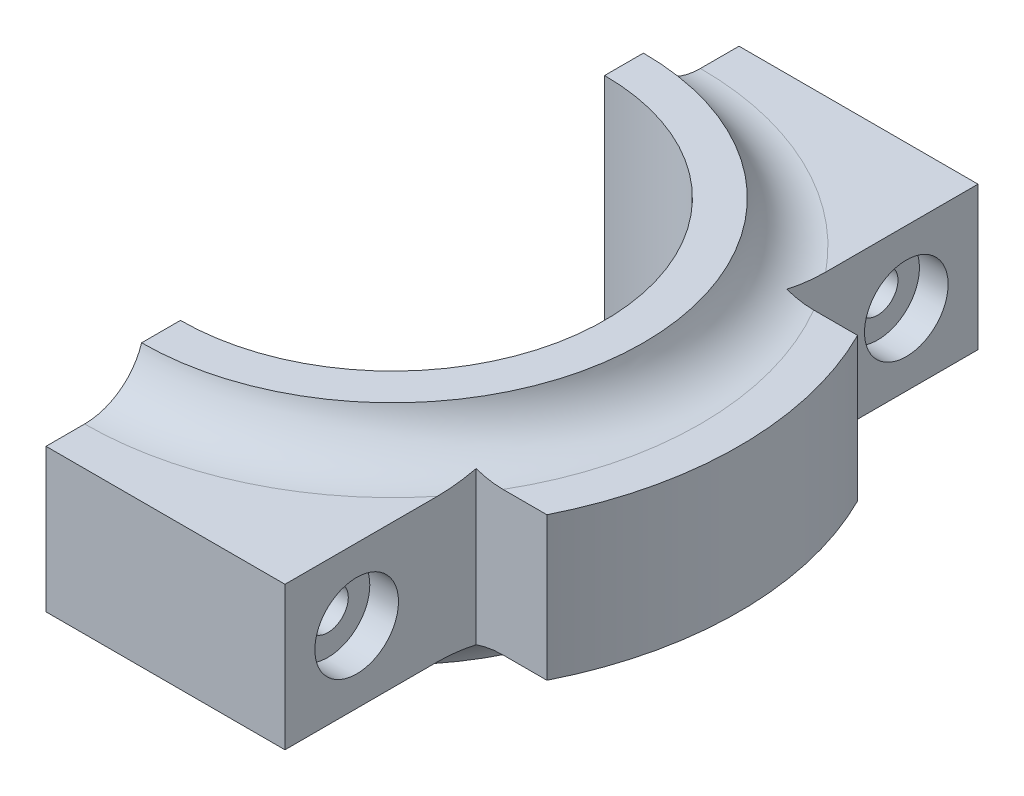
ISO-10303-21;
HEADER;
FILE_DESCRIPTION(('STEP AP214'),'2;1');
FILE_NAME('part.step','',(''),(''),'','','');
FILE_SCHEMA(('AUTOMOTIVE_DESIGN { 1 0 10303 214 1 1 1 1 }'));
ENDSEC;
DATA;
#1=APPLICATION_CONTEXT('core data for automotive mechanical design processes');
#2=APPLICATION_PROTOCOL_DEFINITION('international standard','automotive_design',2000,#1);
#3=PRODUCT_CONTEXT('',#1,'mechanical');
#4=PRODUCT('Part','Part','',(#3));
#5=PRODUCT_RELATED_PRODUCT_CATEGORY('part','',(#4));
#6=PRODUCT_DEFINITION_FORMATION('','',#4);
#7=PRODUCT_DEFINITION_CONTEXT('part definition',#1,'design');
#8=PRODUCT_DEFINITION('design','',#6,#7);
#9=PRODUCT_DEFINITION_SHAPE('','',#8);
#10=(LENGTH_UNIT() NAMED_UNIT(*) SI_UNIT(.MILLI.,.METRE.));
#11=(NAMED_UNIT(*) PLANE_ANGLE_UNIT() SI_UNIT($,.RADIAN.));
#12=(NAMED_UNIT(*) SI_UNIT($,.STERADIAN.) SOLID_ANGLE_UNIT());
#13=UNCERTAINTY_MEASURE_WITH_UNIT(LENGTH_MEASURE(1.E-05),#10,'distance_accuracy_value','');
#14=(GEOMETRIC_REPRESENTATION_CONTEXT(3) GLOBAL_UNCERTAINTY_ASSIGNED_CONTEXT((#13)) GLOBAL_UNIT_ASSIGNED_CONTEXT((#10,
#11,#12)) REPRESENTATION_CONTEXT('',''));
#15=CARTESIAN_POINT('',(0.,0.,0.));
#16=DIRECTION('',(0.,0.,1.));
#17=DIRECTION('',(1.,0.,0.));
#18=AXIS2_PLACEMENT_3D('',#15,#16,#17);
#19=CARTESIAN_POINT('',(0.,-10.0254037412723,-51.7070723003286));
#20=DIRECTION('',(-1.,0.,0.));
#21=DIRECTION('',(0.,0.,1.));
#22=AXIS2_PLACEMENT_3D('',#19,#20,#21);
#23=PLANE('',#22);
#24=CARTESIAN_POINT('',(0.,0.,-23.));
#25=DIRECTION('',(-1.,0.,0.));
#26=DIRECTION('',(0.,0.,1.));
#27=AXIS2_PLACEMENT_3D('',#24,#25,#26);
#28=CIRCLE('',#27,1.7);
#29=CARTESIAN_POINT('',(0.,0.,-21.3));
#30=VERTEX_POINT('',#29);
#31=EDGE_CURVE('E178',#30,#30,#28,.T.);
#32=ORIENTED_EDGE('',*,*,#31,.F.);
#33=EDGE_LOOP('',(#32));
#34=FACE_BOUND('',#33,.T.);
#35=CARTESIAN_POINT('',(0.,-11.,-25.7696960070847));
#36=DIRECTION('',(-1.,0.,0.));
#37=DIRECTION('',(0.,0.,1.));
#38=AXIS2_PLACEMENT_3D('',#35,#36,#37);
#39=CIRCLE('',#38,5.);
#40=CARTESIAN_POINT('',(0.,-6.,-25.7696960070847));
#41=VERTEX_POINT('',#40);
#42=CARTESIAN_POINT('',(0.,-9.5,-21.));
#43=VERTEX_POINT('',#42);
#44=EDGE_CURVE('E211',#41,#43,#39,.F.);
#45=ORIENTED_EDGE('',*,*,#44,.T.);
#46=DIRECTION('',(0.,0.,1.));
#47=VECTOR('',#46,1.);
#48=CARTESIAN_POINT('',(0.,-9.5,0.));
#49=LINE('',#48,#47);
#50=CARTESIAN_POINT('',(0.,-9.5,-17.75));
#51=VERTEX_POINT('',#50);
#52=EDGE_CURVE('E180',#43,#51,#49,.T.);
#53=ORIENTED_EDGE('',*,*,#52,.T.);
#54=DIRECTION('',(0.,-1.,0.));
#55=VECTOR('',#54,1.);
#56=CARTESIAN_POINT('',(0.,6.,-17.75));
#57=LINE('',#56,#55);
#58=CARTESIAN_POINT('',(0.,9.5,-17.75));
#59=VERTEX_POINT('',#58);
#60=EDGE_CURVE('E224',#59,#51,#57,.T.);
#61=ORIENTED_EDGE('',*,*,#60,.F.);
#62=DIRECTION('',(0.,0.,1.));
#63=VECTOR('',#62,1.);
#64=CARTESIAN_POINT('',(0.,9.5,0.));
#65=LINE('',#64,#63);
#66=CARTESIAN_POINT('',(0.,9.5,-21.));
#67=VERTEX_POINT('',#66);
#68=EDGE_CURVE('E229',#67,#59,#65,.T.);
#69=ORIENTED_EDGE('',*,*,#68,.F.);
#70=CARTESIAN_POINT('',(0.,11.,-25.7696960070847));
#71=DIRECTION('',(-1.,0.,0.));
#72=DIRECTION('',(0.,0.,1.));
#73=AXIS2_PLACEMENT_3D('',#70,#71,#72);
#74=CIRCLE('',#73,5.);
#75=CARTESIAN_POINT('',(0.,6.,-25.7696960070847));
#76=VERTEX_POINT('',#75);
#77=EDGE_CURVE('E215',#67,#76,#74,.F.);
#78=ORIENTED_EDGE('',*,*,#77,.T.);
#79=DIRECTION('',(0.,0.,1.));
#80=VECTOR('',#79,1.);
#81=CARTESIAN_POINT('',(0.,6.,0.));
#82=LINE('',#81,#80);
#83=CARTESIAN_POINT('',(0.,6.,-29.));
#84=VERTEX_POINT('',#83);
#85=EDGE_CURVE('E220',#84,#76,#82,.T.);
#86=ORIENTED_EDGE('',*,*,#85,.F.);
#87=DIRECTION('',(0.,-1.,0.));
#88=VECTOR('',#87,1.);
#89=CARTESIAN_POINT('',(0.,6.,-29.));
#90=LINE('',#89,#88);
#91=CARTESIAN_POINT('',(0.,-6.,-29.));
#92=VERTEX_POINT('',#91);
#93=EDGE_CURVE('E232',#92,#84,#90,.F.);
#94=ORIENTED_EDGE('',*,*,#93,.F.);
#95=DIRECTION('',(0.,0.,1.));
#96=VECTOR('',#95,1.);
#97=CARTESIAN_POINT('',(0.,-6.,0.));
#98=LINE('',#97,#96);
#99=EDGE_CURVE('E172',#92,#41,#98,.T.);
#100=ORIENTED_EDGE('',*,*,#99,.T.);
#101=EDGE_LOOP('',(#45,#53,#61,#69,#78,#86,#94,#100));
#102=FACE_BOUND('',#101,.T.);
#103=ADVANCED_FACE('F32',(#34,#102),#23,.T.);
#104=CARTESIAN_POINT('',(0.,0.,23.));
#105=DIRECTION('',(-1.,0.,0.));
#106=DIRECTION('',(0.,0.,1.));
#107=AXIS2_PLACEMENT_3D('',#104,#105,#106);
#108=CIRCLE('',#107,1.7);
#109=CARTESIAN_POINT('',(0.,0.,24.7));
#110=VERTEX_POINT('',#109);
#111=EDGE_CURVE('E36',#110,#110,#108,.T.);
#112=ORIENTED_EDGE('',*,*,#111,.F.);
#113=EDGE_LOOP('',(#112));
#114=FACE_BOUND('',#113,.T.);
#115=DIRECTION('',(0.,-1.,0.));
#116=VECTOR('',#115,1.);
#117=CARTESIAN_POINT('',(0.,6.,17.75));
#118=LINE('',#117,#116);
#119=CARTESIAN_POINT('',(0.,-9.5,17.75));
#120=VERTEX_POINT('',#119);
#121=CARTESIAN_POINT('',(0.,9.5,17.75));
#122=VERTEX_POINT('',#121);
#123=EDGE_CURVE('E226',#120,#122,#118,.F.);
#124=ORIENTED_EDGE('',*,*,#123,.F.);
#125=CARTESIAN_POINT('',(0.,-9.5,21.));
#126=VERTEX_POINT('',#125);
#127=EDGE_CURVE('E177',#120,#126,#49,.T.);
#128=ORIENTED_EDGE('',*,*,#127,.T.);
#129=CARTESIAN_POINT('',(0.,-11.,25.7696960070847));
#130=DIRECTION('',(-1.,0.,0.));
#131=DIRECTION('',(0.,0.,1.));
#132=AXIS2_PLACEMENT_3D('',#129,#130,#131);
#133=CIRCLE('',#132,5.);
#134=CARTESIAN_POINT('',(0.,-6.,25.7696960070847));
#135=VERTEX_POINT('',#134);
#136=EDGE_CURVE('E171',#126,#135,#133,.F.);
#137=ORIENTED_EDGE('',*,*,#136,.T.);
#138=CARTESIAN_POINT('',(0.,-6.,29.));
#139=VERTEX_POINT('',#138);
#140=EDGE_CURVE('E159',#135,#139,#98,.T.);
#141=ORIENTED_EDGE('',*,*,#140,.T.);
#142=DIRECTION('',(0.,-1.,0.));
#143=VECTOR('',#142,1.);
#144=CARTESIAN_POINT('',(0.,6.,29.));
#145=LINE('',#144,#143);
#146=CARTESIAN_POINT('',(0.,6.,29.));
#147=VERTEX_POINT('',#146);
#148=EDGE_CURVE('E168',#139,#147,#145,.F.);
#149=ORIENTED_EDGE('',*,*,#148,.T.);
#150=CARTESIAN_POINT('',(0.,6.,25.7696960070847));
#151=VERTEX_POINT('',#150);
#152=EDGE_CURVE('E223',#151,#147,#82,.T.);
#153=ORIENTED_EDGE('',*,*,#152,.F.);
#154=CARTESIAN_POINT('',(0.,11.,25.7696960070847));
#155=DIRECTION('',(-1.,0.,0.));
#156=DIRECTION('',(0.,0.,1.));
#157=AXIS2_PLACEMENT_3D('',#154,#155,#156);
#158=CIRCLE('',#157,5.);
#159=CARTESIAN_POINT('',(0.,9.5,21.));
#160=VERTEX_POINT('',#159);
#161=EDGE_CURVE('E173',#151,#160,#158,.F.);
#162=ORIENTED_EDGE('',*,*,#161,.T.);
#163=EDGE_CURVE('E231',#122,#160,#65,.T.);
#164=ORIENTED_EDGE('',*,*,#163,.F.);
#165=EDGE_LOOP('',(#124,#128,#137,#141,#149,#153,#162,#164));
#166=FACE_BOUND('',#165,.T.);
#167=ADVANCED_FACE('F166',(#114,#166),#23,.T.);
#168=CARTESIAN_POINT('',(0.,6.,0.));
#169=DIRECTION('',(0.,1.,0.));
#170=DIRECTION('',(0.,0.,1.));
#171=AXIS2_PLACEMENT_3D('',#168,#169,#170);
#172=PLANE('',#171);
#173=DIRECTION('',(1.,0.,0.));
#174=VECTOR('',#173,1.);
#175=CARTESIAN_POINT('',(-500000.,6.,-28.9999999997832));
#176=LINE('',#175,#174);
#177=CARTESIAN_POINT('',(20.,6.,-29.));
#178=VERTEX_POINT('',#177);
#179=EDGE_CURVE('E235',#84,#178,#176,.T.);
#180=ORIENTED_EDGE('',*,*,#179,.F.);
#181=ORIENTED_EDGE('',*,*,#85,.T.);
#182=CARTESIAN_POINT('',(0.,6.,0.));
#183=DIRECTION('',(0.,1.,0.));
#184=DIRECTION('',(0.,0.,1.));
#185=AXIS2_PLACEMENT_3D('',#182,#183,#184);
#186=CIRCLE('',#185,25.7696960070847);
#187=CARTESIAN_POINT('',(20.,6.,-16.250453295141));
#188=VERTEX_POINT('',#187);
#189=EDGE_CURVE('E203',#76,#188,#186,.F.);
#190=ORIENTED_EDGE('',*,*,#189,.T.);
#191=DIRECTION('',(0.,0.,-1.));
#192=VECTOR('',#191,1.);
#193=CARTESIAN_POINT('',(20.,6.,0.));
#194=LINE('',#193,#192);
#195=EDGE_CURVE('E254',#188,#178,#194,.T.);
#196=ORIENTED_EDGE('',*,*,#195,.T.);
#197=EDGE_LOOP('',(#180,#181,#190,#196));
#198=FACE_BOUND('',#197,.T.);
#199=ADVANCED_FACE('F387',(#198),#172,.T.);
#200=CARTESIAN_POINT('',(20.,6.,16.250453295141));
#201=VERTEX_POINT('',#200);
#202=EDGE_CURVE('E204',#201,#151,#186,.F.);
#203=ORIENTED_EDGE('',*,*,#202,.T.);
#204=ORIENTED_EDGE('',*,*,#152,.T.);
#205=DIRECTION('',(1.,0.,0.));
#206=VECTOR('',#205,1.);
#207=CARTESIAN_POINT('',(-500000.,6.,29.0000000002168));
#208=LINE('',#207,#206);
#209=CARTESIAN_POINT('',(20.,6.,29.));
#210=VERTEX_POINT('',#209);
#211=EDGE_CURVE('E41',#147,#210,#208,.T.);
#212=ORIENTED_EDGE('',*,*,#211,.T.);
#213=DIRECTION('',(0.,0.,-1.));
#214=VECTOR('',#213,1.);
#215=CARTESIAN_POINT('',(20.,6.,0.));
#216=LINE('',#215,#214);
#217=EDGE_CURVE('E56',#210,#201,#216,.T.);
#218=ORIENTED_EDGE('',*,*,#217,.T.);
#219=EDGE_LOOP('',(#203,#204,#212,#218));
#220=FACE_BOUND('',#219,.T.);
#221=ADVANCED_FACE('F400',(#220),#172,.T.);
#222=CARTESIAN_POINT('',(0.,-6.,0.));
#223=DIRECTION('',(0.,1.,0.));
#224=DIRECTION('',(0.,0.,1.));
#225=AXIS2_PLACEMENT_3D('',#222,#223,#224);
#226=PLANE('',#225);
#227=ORIENTED_EDGE('',*,*,#99,.F.);
#228=DIRECTION('',(1.,0.,0.));
#229=VECTOR('',#228,1.);
#230=CARTESIAN_POINT('',(-500000.,-6.,-28.9999999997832));
#231=LINE('',#230,#229);
#232=CARTESIAN_POINT('',(20.,-6.,-29.));
#233=VERTEX_POINT('',#232);
#234=EDGE_CURVE('E241',#92,#233,#231,.T.);
#235=ORIENTED_EDGE('',*,*,#234,.T.);
#236=DIRECTION('',(0.,0.,-1.));
#237=VECTOR('',#236,1.);
#238=CARTESIAN_POINT('',(20.,-6.,0.));
#239=LINE('',#238,#237);
#240=CARTESIAN_POINT('',(20.,-6.,-16.250453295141));
#241=VERTEX_POINT('',#240);
#242=EDGE_CURVE('E252',#241,#233,#239,.T.);
#243=ORIENTED_EDGE('',*,*,#242,.F.);
#244=CARTESIAN_POINT('',(0.,-6.,0.));
#245=DIRECTION('',(0.,1.,0.));
#246=DIRECTION('',(0.,0.,1.));
#247=AXIS2_PLACEMENT_3D('',#244,#245,#246);
#248=CIRCLE('',#247,25.7696960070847);
#249=EDGE_CURVE('E207',#241,#41,#248,.T.);
#250=ORIENTED_EDGE('',*,*,#249,.T.);
#251=EDGE_LOOP('',(#227,#235,#243,#250));
#252=FACE_BOUND('',#251,.T.);
#253=ADVANCED_FACE('F397',(#252),#226,.F.);
#254=ORIENTED_EDGE('',*,*,#140,.F.);
#255=CARTESIAN_POINT('',(20.,-6.,16.250453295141));
#256=VERTEX_POINT('',#255);
#257=EDGE_CURVE('E208',#135,#256,#248,.T.);
#258=ORIENTED_EDGE('',*,*,#257,.T.);
#259=DIRECTION('',(0.,0.,-1.));
#260=VECTOR('',#259,1.);
#261=CARTESIAN_POINT('',(20.,-6.,0.));
#262=LINE('',#261,#260);
#263=CARTESIAN_POINT('',(20.,-6.,29.));
#264=VERTEX_POINT('',#263);
#265=EDGE_CURVE('E49',#264,#256,#262,.T.);
#266=ORIENTED_EDGE('',*,*,#265,.F.);
#267=DIRECTION('',(1.,0.,0.));
#268=VECTOR('',#267,1.);
#269=CARTESIAN_POINT('',(-500000.,-6.,29.0000000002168));
#270=LINE('',#269,#268);
#271=EDGE_CURVE('E11',#139,#264,#270,.T.);
#272=ORIENTED_EDGE('',*,*,#271,.F.);
#273=EDGE_LOOP('',(#254,#258,#266,#272));
#274=FACE_BOUND('',#273,.T.);
#275=ADVANCED_FACE('F158',(#274),#226,.F.);
#276=CARTESIAN_POINT('',(0.,11.,0.));
#277=DIRECTION('',(0.,1.,0.));
#278=DIRECTION('',(0.,0.,1.));
#279=AXIS2_PLACEMENT_3D('',#276,#277,#278);
#280=TOROIDAL_SURFACE('',#279,25.7696960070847,5.);
#281=ORIENTED_EDGE('',*,*,#161,.F.);
#282=ORIENTED_EDGE('',*,*,#202,.F.);
#283=CARTESIAN_POINT('',(20.,6.142806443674,14.2946086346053));
#284=CARTESIAN_POINT('',(20.,6.08922512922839,14.6718593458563));
#285=CARTESIAN_POINT('',(20.,6.04967167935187,15.0511233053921));
#286=CARTESIAN_POINT('',(20.,6.0021646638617,15.8118718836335));
#287=CARTESIAN_POINT('',(20.,5.99422221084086,16.1933572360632));
#288=CARTESIAN_POINT('',(20.,6.0141939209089,16.954171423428));
#289=CARTESIAN_POINT('',(20.,6.04198071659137,17.3335031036));
#290=CARTESIAN_POINT('',(20.,6.13806110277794,18.0867723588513));
#291=CARTESIAN_POINT('',(20.,6.20630752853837,18.4607156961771));
#292=CARTESIAN_POINT('',(20.,6.38711565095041,19.1907206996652));
#293=CARTESIAN_POINT('',(20.,6.49883974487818,19.546984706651));
#294=CARTESIAN_POINT('',(20.,6.77202746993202,20.2400383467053));
#295=CARTESIAN_POINT('',(20.,6.93344710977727,20.5768448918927));
#296=CARTESIAN_POINT('',(20.,7.27911914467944,21.1645904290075));
#297=CARTESIAN_POINT('',(20.,7.45490175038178,21.4204212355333));
#298=CARTESIAN_POINT('',(20.,7.74773177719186,21.780129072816));
#299=CARTESIAN_POINT('',(20.,7.85018841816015,21.8960139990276));
#300=CARTESIAN_POINT('',(20.,8.06484130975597,22.1184165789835));
#301=CARTESIAN_POINT('',(20.,8.17703504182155,22.2249366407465));
#302=CARTESIAN_POINT('',(20.,8.38694960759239,22.4063259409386));
#303=CARTESIAN_POINT('',(20.,8.4829334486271,22.4832112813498));
#304=CARTESIAN_POINT('',(20.,8.6806324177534,22.6292092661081));
#305=CARTESIAN_POINT('',(20.,8.78234628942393,22.6983236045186));
#306=CARTESIAN_POINT('',(20.,8.99113707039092,22.827937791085));
#307=CARTESIAN_POINT('',(20.,9.0982140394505,22.8884375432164));
#308=CARTESIAN_POINT('',(20.,9.31715152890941,22.9999584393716));
#309=CARTESIAN_POINT('',(20.,9.42900997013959,23.0509836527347));
#310=CARTESIAN_POINT('',(20.,9.65768996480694,23.1431347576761));
#311=CARTESIAN_POINT('',(20.,9.77454161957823,23.1841862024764));
#312=CARTESIAN_POINT('',(20.,10.011519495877,23.2551903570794));
#313=CARTESIAN_POINT('',(20.,10.1316441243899,23.285148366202));
#314=CARTESIAN_POINT('',(20.,10.3741889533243,23.3334416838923));
#315=CARTESIAN_POINT('',(20.,10.4966086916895,23.3517793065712));
#316=CARTESIAN_POINT('',(20.,10.7426453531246,23.3764877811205));
#317=CARTESIAN_POINT('',(20.,10.866262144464,23.3828599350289));
#318=CARTESIAN_POINT('',(20.,11.0996704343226,23.3834826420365));
#319=CARTESIAN_POINT('',(20.,11.2094604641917,23.3790103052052));
#320=CARTESIAN_POINT('',(20.,11.4282800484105,23.3606061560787));
#321=CARTESIAN_POINT('',(20.,11.5373093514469,23.3466713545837));
#322=CARTESIAN_POINT('',(20.,11.7537272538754,23.3095547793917));
#323=CARTESIAN_POINT('',(20.,11.8611166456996,23.2863776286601));
#324=CARTESIAN_POINT('',(20.,12.0735946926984,23.2311236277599));
#325=CARTESIAN_POINT('',(20.,12.1786824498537,23.1990433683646));
#326=CARTESIAN_POINT('',(20.,12.4871688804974,23.0908761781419));
#327=CARTESIAN_POINT('',(20.,12.6863534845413,23.0024083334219));
#328=CARTESIAN_POINT('',(20.,13.0689705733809,22.7966112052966));
#329=CARTESIAN_POINT('',(20.,13.2523988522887,22.6792742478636));
#330=CARTESIAN_POINT('',(20.,13.6209677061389,22.4057710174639));
#331=CARTESIAN_POINT('',(20.,13.8039589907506,22.2467151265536));
#332=CARTESIAN_POINT('',(20.,14.1461302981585,21.9049465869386));
#333=CARTESIAN_POINT('',(20.,14.3052955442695,21.7222193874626));
#334=CARTESIAN_POINT('',(20.,14.6804822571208,21.2333152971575));
#335=CARTESIAN_POINT('',(20.,14.8799436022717,20.914309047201));
#336=CARTESIAN_POINT('',(20.,15.1386419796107,20.4153365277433));
#337=CARTESIAN_POINT('',(20.,15.2182222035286,20.2453082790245));
#338=CARTESIAN_POINT('',(20.,15.364555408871,19.8998054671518));
#339=CARTESIAN_POINT('',(20.,15.4313083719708,19.7243308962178));
#340=CARTESIAN_POINT('',(20.,15.6656795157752,19.0384339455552));
#341=CARTESIAN_POINT('',(20.,15.7897278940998,18.5125990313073));
#342=CARTESIAN_POINT('',(20.,15.9127951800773,17.7157519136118));
#343=CARTESIAN_POINT('',(20.,15.9433161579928,17.4486397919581));
#344=CARTESIAN_POINT('',(20.,15.9852594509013,16.9128392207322));
#345=CARTESIAN_POINT('',(20.,15.9966826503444,16.6441508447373));
#346=CARTESIAN_POINT('',(20.,16.0034799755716,15.9659620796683));
#347=CARTESIAN_POINT('',(20.,15.9873280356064,15.5563502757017));
#348=CARTESIAN_POINT('',(20.,15.9196172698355,14.7399668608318));
#349=CARTESIAN_POINT('',(20.,15.8680354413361,14.3331972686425));
#350=CARTESIAN_POINT('',(20.,15.7331749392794,13.5223796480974));
#351=CARTESIAN_POINT('',(20.,15.649697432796,13.1183652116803));
#352=CARTESIAN_POINT('',(20.,15.4544158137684,12.3174898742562));
#353=CARTESIAN_POINT('',(20.,15.3426263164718,11.9206253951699));
#354=CARTESIAN_POINT('',(20.,15.1517289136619,11.3202043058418));
#355=CARTESIAN_POINT('',(20.,15.0820137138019,11.113606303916));
#356=CARTESIAN_POINT('',(20.,14.9354395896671,10.70296350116));
#357=CARTESIAN_POINT('',(20.,14.8585810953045,10.4989185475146));
#358=CARTESIAN_POINT('',(20.,14.6976572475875,10.0933168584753));
#359=CARTESIAN_POINT('',(20.,14.6135806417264,9.89176458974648));
#360=CARTESIAN_POINT('',(20.,14.4382254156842,9.49183167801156));
#361=CARTESIAN_POINT('',(20.,14.3469473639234,9.29345078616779));
#362=CARTESIAN_POINT('',(20.,14.1577132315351,8.90211300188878));
#363=CARTESIAN_POINT('',(20.,14.0598254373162,8.70912318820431));
#364=CARTESIAN_POINT('',(20.,13.856002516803,8.3274590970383));
#365=CARTESIAN_POINT('',(20.,13.7500683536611,8.13878430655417));
#366=CARTESIAN_POINT('',(20.,13.5292514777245,7.76729490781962));
#367=CARTESIAN_POINT('',(20.,13.414390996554,7.58446724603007));
#368=CARTESIAN_POINT('',(20.,13.2337744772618,7.31591308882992));
#369=CARTESIAN_POINT('',(20.,13.1722003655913,7.22736773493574));
#370=CARTESIAN_POINT('',(20.,13.0458811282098,7.05257391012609));
#371=CARTESIAN_POINT('',(20.,12.9811364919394,6.96632508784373));
#372=CARTESIAN_POINT('',(20.,12.8710291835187,6.826050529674));
#373=CARTESIAN_POINT('',(20.,12.8267137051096,6.77120354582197));
#374=CARTESIAN_POINT('',(20.,12.7363410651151,6.66296283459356));
#375=CARTESIAN_POINT('',(20.,12.6902838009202,6.60956919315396));
#376=CARTESIAN_POINT('',(20.,12.5490198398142,6.45176199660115));
#377=CARTESIAN_POINT('',(20.,12.4508707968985,6.34991655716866));
#378=CARTESIAN_POINT('',(20.,12.2437478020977,6.15559658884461));
#379=CARTESIAN_POINT('',(20.,12.1346777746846,6.06322293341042));
#380=CARTESIAN_POINT('',(20.,11.9039806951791,5.89556904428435));
#381=CARTESIAN_POINT('',(20.,11.7823978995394,5.82023138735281));
#382=CARTESIAN_POINT('',(20.,11.5788060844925,5.72319705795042));
#383=CARTESIAN_POINT('',(20.,11.5012947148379,5.69221168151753));
#384=CARTESIAN_POINT('',(20.,11.3423711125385,5.64287973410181));
#385=CARTESIAN_POINT('',(20.,11.2609664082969,5.62450974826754));
#386=CARTESIAN_POINT('',(20.,11.0954604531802,5.60264544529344));
#387=CARTESIAN_POINT('',(20.,11.0113431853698,5.59926760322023));
#388=CARTESIAN_POINT('',(20.,10.843930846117,5.60823440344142));
#389=CARTESIAN_POINT('',(20.,10.7606364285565,5.62059067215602));
#390=CARTESIAN_POINT('',(20.,10.583946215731,5.66245478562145));
#391=CARTESIAN_POINT('',(20.,10.4911590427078,5.69446198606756));
#392=CARTESIAN_POINT('',(20.,10.3118791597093,5.77284585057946));
#393=CARTESIAN_POINT('',(20.,10.2254014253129,5.81925541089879));
#394=CARTESIAN_POINT('',(20.,10.0683533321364,5.91636559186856));
#395=CARTESIAN_POINT('',(20.,9.9970922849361,5.96597826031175));
#396=CARTESIAN_POINT('',(20.,9.85903990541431,6.07112797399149));
#397=CARTESIAN_POINT('',(20.,9.79225254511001,6.12667017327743));
#398=CARTESIAN_POINT('',(20.,9.66243914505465,6.24231695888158));
#399=CARTESIAN_POINT('',(20.,9.59942483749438,6.30243457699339));
#400=CARTESIAN_POINT('',(20.,9.47685109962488,6.42602462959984));
#401=CARTESIAN_POINT('',(20.,9.4172904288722,6.48949584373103));
#402=CARTESIAN_POINT('',(20.,9.26630441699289,6.65791235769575));
#403=CARTESIAN_POINT('',(20.,9.17717723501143,6.76491425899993));
#404=CARTESIAN_POINT('',(20.,9.00499799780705,6.98372959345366));
#405=CARTESIAN_POINT('',(20.,8.9219492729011,7.09554561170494));
#406=CARTESIAN_POINT('',(20.,8.76081394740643,7.32297266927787));
#407=CARTESIAN_POINT('',(20.,8.68273616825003,7.43858993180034));
#408=CARTESIAN_POINT('',(20.,8.53097890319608,7.67268474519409));
#409=CARTESIAN_POINT('',(20.,8.45730013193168,7.79116275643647));
#410=CARTESIAN_POINT('',(20.,8.24151802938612,8.1509980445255));
#411=CARTESIAN_POINT('',(20.,8.1052752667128,8.39587954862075));
#412=CARTESIAN_POINT('',(20.,7.84607349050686,8.89219707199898));
#413=CARTESIAN_POINT('',(20.,7.72310176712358,9.14362652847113));
#414=CARTESIAN_POINT('',(20.,7.51680641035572,9.59200659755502));
#415=CARTESIAN_POINT('',(20.,7.43097547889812,9.78780844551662));
#416=CARTESIAN_POINT('',(20.,7.26615991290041,10.1822595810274));
#417=CARTESIAN_POINT('',(20.,7.18717521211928,10.3809088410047));
#418=CARTESIAN_POINT('',(20.,6.96033116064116,10.9809510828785));
#419=CARTESIAN_POINT('',(20.,6.82266531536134,11.386256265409));
#420=CARTESIAN_POINT('',(20.,6.57608847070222,12.204825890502));
#421=CARTESIAN_POINT('',(20.,6.46713310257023,12.6180769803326));
#422=CARTESIAN_POINT('',(20.,6.28051985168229,13.4515799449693));
#423=CARTESIAN_POINT('',(20.,6.20285413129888,13.8718300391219));
#424=CARTESIAN_POINT('',(20.,6.142806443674,14.2946086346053));
#425=B_SPLINE_CURVE_WITH_KNOTS('',3,(#283,#284,#285,#286,#287,#288,#289,#290,#291,#292,#293,
#294,#295,#296,#297,#298,#299,#300,#301,#302,#303,#304,#305,#306,#307,#308,#309,#310,#311,#312,
#313,#314,#315,#316,#317,#318,#319,#320,#321,#322,#323,#324,#325,#326,#327,#328,#329,#330,#331,
#332,#333,#334,#335,#336,#337,#338,#339,#340,#341,#342,#343,#344,#345,#346,#347,#348,#349,#350,
#351,#352,#353,#354,#355,#356,#357,#358,#359,#360,#361,#362,#363,#364,#365,#366,#367,#368,#369,
#370,#371,#372,#373,#374,#375,#376,#377,#378,#379,#380,#381,#382,#383,#384,#385,#386,#387,#388,
#389,#390,#391,#392,#393,#394,#395,#396,#397,#398,#399,#400,#401,#402,#403,#404,#405,#406,#407,
#408,#409,#410,#411,#412,#413,#414,#415,#416,#417,#418,#419,#420,#421,#422,#423,#424),
.UNSPECIFIED.,.T.,.F.,(4,2,2,2,2,2,2,2,2,2,2,2,2,2,2,2,2,2,2,2,2,2,2,2,2,2,2,2,2,2,2,2,2,2,2,2,
2,2,2,2,2,2,2,2,2,2,2,2,2,2,2,2,2,2,2,2,2,2,2,2,2,2,2,2,2,2,2,2,2,2,4),(0.,1.14281513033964,
2.28603197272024,3.42518475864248,4.56301221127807,5.67992559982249,6.79585310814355,
7.7231780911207,8.18673981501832,8.65018199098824,9.01878049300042,9.38729848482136,
9.75582058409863,10.1241840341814,10.4952179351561,10.8660743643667,11.2368569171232,
11.6075991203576,11.9368381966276,12.2661813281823,12.5953599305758,12.924664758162,
13.5755604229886,14.2266292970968,14.951278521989,15.6763753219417,16.7983275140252,
17.3611390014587,17.9239512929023,19.5345119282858,20.3406684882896,21.146787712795,
22.3747325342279,23.6034753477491,24.8400063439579,26.0759003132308,26.729922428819,
27.3839052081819,28.0389266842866,28.6938965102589,29.3429094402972,29.9918448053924,
30.6392127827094,30.962709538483,31.2861565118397,31.4976605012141,31.7091769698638,
32.1329447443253,32.5608377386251,32.9872661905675,33.2368578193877,33.485984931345,
33.7370441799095,33.9882890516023,34.2810997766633,34.5745842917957,34.8346978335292,
35.0950393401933,35.3561523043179,35.6171708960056,36.0346365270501,36.4523291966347,
36.8707435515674,37.289225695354,38.1293820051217,38.968726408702,39.6099573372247,
40.2511820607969,41.534231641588,42.8152866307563,44.0960205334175),.UNSPECIFIED.);
#426=CARTESIAN_POINT('',(19.9999999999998,6.38166270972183,13.));
#427=VERTEX_POINT('',#426);
#428=EDGE_CURVE('E188',#427,#201,#425,.T.);
#429=ORIENTED_EDGE('',*,*,#428,.F.);
#430=CARTESIAN_POINT('',(20.5441454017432,6.21727726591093,13.));
#431=CARTESIAN_POINT('',(20.1308784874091,6.32372928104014,13.));
#432=CARTESIAN_POINT('',(19.7272276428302,6.46854513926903,13.));
#433=CARTESIAN_POINT('',(18.9544648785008,6.83214728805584,13.));
#434=CARTESIAN_POINT('',(18.5853397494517,7.05090513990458,13.));
#435=CARTESIAN_POINT('',(18.000105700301,7.48546844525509,13.));
#436=CARTESIAN_POINT('',(17.7707595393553,7.6835429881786,13.));
#437=CARTESIAN_POINT('',(17.3472385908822,8.11409917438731,13.));
#438=CARTESIAN_POINT('',(17.1530007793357,8.34651777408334,13.));
#439=CARTESIAN_POINT('',(16.8410817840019,8.79795421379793,13.));
#440=CARTESIAN_POINT('',(16.7159036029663,9.01174083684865,13.));
#441=CARTESIAN_POINT('',(16.555868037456,9.34557022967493,13.));
#442=CARTESIAN_POINT('',(16.507134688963,9.45907310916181,13.));
#443=CARTESIAN_POINT('',(16.4196747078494,9.6898506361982,13.));
#444=CARTESIAN_POINT('',(16.380943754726,9.80712363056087,13.));
#445=CARTESIAN_POINT('',(16.3139607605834,10.045474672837,13.));
#446=CARTESIAN_POINT('',(16.2857801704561,10.1665728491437,13.));
#447=CARTESIAN_POINT('',(16.240831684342,10.4108795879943,13.));
#448=CARTESIAN_POINT('',(16.2240637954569,10.5340881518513,13.));
#449=CARTESIAN_POINT('',(16.2023101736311,10.7814965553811,13.));
#450=CARTESIAN_POINT('',(16.197319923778,10.9056959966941,13.));
#451=CARTESIAN_POINT('',(16.1992214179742,11.1539975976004,13.));
#452=CARTESIAN_POINT('',(16.2061121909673,11.2780997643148,13.));
#453=CARTESIAN_POINT('',(16.2302708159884,11.5120595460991,13.));
#454=CARTESIAN_POINT('',(16.246368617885,11.6220401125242,13.));
#455=CARTESIAN_POINT('',(16.2876710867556,11.8403119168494,13.));
#456=CARTESIAN_POINT('',(16.3128787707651,11.9486025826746,13.));
#457=CARTESIAN_POINT('',(16.3719878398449,12.1627514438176,13.));
#458=CARTESIAN_POINT('',(16.4058869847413,12.268610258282,13.));
#459=CARTESIAN_POINT('',(16.4818749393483,12.4773617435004,13.));
#460=CARTESIAN_POINT('',(16.5239669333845,12.5802532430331,13.));
#461=CARTESIAN_POINT('',(16.6651953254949,12.8913832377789,13.));
#462=CARTESIAN_POINT('',(16.7770191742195,13.093990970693,13.));
#463=CARTESIAN_POINT('',(17.0282332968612,13.4810832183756,13.));
#464=CARTESIAN_POINT('',(17.1676353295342,13.6655599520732,13.));
#465=CARTESIAN_POINT('',(17.4950639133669,14.0449369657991,13.));
#466=CARTESIAN_POINT('',(17.6873297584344,14.2361767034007,13.));
#467=CARTESIAN_POINT('',(18.0962944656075,14.5903657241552,13.));
#468=CARTESIAN_POINT('',(18.3130098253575,14.7532957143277,13.));
#469=CARTESIAN_POINT('',(18.8121596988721,15.0807967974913,13.));
#470=CARTESIAN_POINT('',(19.098929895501,15.2387754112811,13.));
#471=CARTESIAN_POINT('',(19.6923714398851,15.5115009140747,13.));
#472=CARTESIAN_POINT('',(19.9990558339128,15.6262191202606,13.));
#473=CARTESIAN_POINT('',(20.6714929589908,15.8246814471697,13.));
#474=CARTESIAN_POINT('',(21.0393227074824,15.9014376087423,13.));
#475=CARTESIAN_POINT('',(21.7829338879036,15.9940436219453,13.));
#476=CARTESIAN_POINT('',(22.1587182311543,16.0098707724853,13.));
#477=CARTESIAN_POINT('',(22.7252592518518,15.9858787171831,13.));
#478=CARTESIAN_POINT('',(22.9172328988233,15.969353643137,13.));
#479=CARTESIAN_POINT('',(23.2989200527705,15.9192790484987,13.));
#480=CARTESIAN_POINT('',(23.4886345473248,15.885737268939,13.));
#481=CARTESIAN_POINT('',(23.8642438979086,15.8013880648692,13.));
#482=CARTESIAN_POINT('',(24.0501376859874,15.7505758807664,13.));
#483=CARTESIAN_POINT('',(24.4161933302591,15.6315944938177,13.));
#484=CARTESIAN_POINT('',(24.5963585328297,15.5634356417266,13.));
#485=CARTESIAN_POINT('',(24.9354113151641,15.4157611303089,13.));
#486=CARTESIAN_POINT('',(25.0948636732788,15.3375419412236,13.));
#487=CARTESIAN_POINT('',(25.4056867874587,15.1665704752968,13.));
#488=CARTESIAN_POINT('',(25.5570620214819,15.0738263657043,13.));
#489=CARTESIAN_POINT('',(25.8500835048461,14.874169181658,13.));
#490=CARTESIAN_POINT('',(25.99173394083,14.7672622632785,13.));
#491=CARTESIAN_POINT('',(26.2636380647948,14.5398201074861,13.));
#492=CARTESIAN_POINT('',(26.3938935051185,14.419286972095,13.));
#493=CARTESIAN_POINT('',(26.6259293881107,14.1811584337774,13.));
#494=CARTESIAN_POINT('',(26.7292382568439,14.0650497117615,13.));
#495=CARTESIAN_POINT('',(26.9246150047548,13.8237369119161,13.));
#496=CARTESIAN_POINT('',(27.016684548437,13.698534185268,13.));
#497=CARTESIAN_POINT('',(27.1884302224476,13.4400019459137,13.));
#498=CARTESIAN_POINT('',(27.2681139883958,13.3066775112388,13.));
#499=CARTESIAN_POINT('',(27.4141288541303,13.0329055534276,13.));
#500=CARTESIAN_POINT('',(27.4804613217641,12.8924587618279,13.));
#501=CARTESIAN_POINT('',(27.592316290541,12.6215750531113,13.));
#502=CARTESIAN_POINT('',(27.63932980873,12.4917519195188,13.));
#503=CARTESIAN_POINT('',(27.7215647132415,12.2284271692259,13.));
#504=CARTESIAN_POINT('',(27.7567872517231,12.0949259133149,13.));
#505=CARTESIAN_POINT('',(27.8150237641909,11.8253367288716,13.));
#506=CARTESIAN_POINT('',(27.8380422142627,11.6892497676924,13.));
#507=CARTESIAN_POINT('',(27.8716168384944,11.4155465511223,13.));
#508=CARTESIAN_POINT('',(27.8821734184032,11.2779303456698,13.));
#509=CARTESIAN_POINT('',(27.8904269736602,11.0111308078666,13.));
#510=CARTESIAN_POINT('',(27.8889030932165,10.8819709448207,13.));
#511=CARTESIAN_POINT('',(27.8748423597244,10.6242079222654,13.));
#512=CARTESIAN_POINT('',(27.862301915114,10.4956049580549,13.));
#513=CARTESIAN_POINT('',(27.8263434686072,10.239995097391,13.));
#514=CARTESIAN_POINT('',(27.8029307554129,10.1129874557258,13.));
#515=CARTESIAN_POINT('',(27.7454616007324,9.86135586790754,13.));
#516=CARTESIAN_POINT('',(27.711401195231,9.73673282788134,13.));
#517=CARTESIAN_POINT('',(27.6333068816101,9.49178267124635,13.));
#518=CARTESIAN_POINT('',(27.5893570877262,9.37142869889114,13.));
#519=CARTESIAN_POINT('',(27.4917379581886,9.1346831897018,13.));
#520=CARTESIAN_POINT('',(27.4380651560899,9.01829308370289,13.));
#521=CARTESIAN_POINT('',(27.3215262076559,8.79025670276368,13.));
#522=CARTESIAN_POINT('',(27.2586626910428,8.67860908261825,13.));
#523=CARTESIAN_POINT('',(27.124267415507,8.46061004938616,13.));
#524=CARTESIAN_POINT('',(27.0527323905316,8.35426065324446,13.));
#525=CARTESIAN_POINT('',(26.8983652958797,8.14300510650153,13.));
#526=CARTESIAN_POINT('',(26.8151802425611,8.03835658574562,13.));
#527=CARTESIAN_POINT('',(26.6407696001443,7.8359682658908,13.));
#528=CARTESIAN_POINT('',(26.5495410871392,7.73823100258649,13.));
#529=CARTESIAN_POINT('',(26.2649224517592,7.45611820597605,13.));
#530=CARTESIAN_POINT('',(26.060488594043,7.28269165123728,13.));
#531=CARTESIAN_POINT('',(25.6103985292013,6.95473292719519,13.));
#532=CARTESIAN_POINT('',(25.3627248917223,6.80299254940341,13.));
#533=CARTESIAN_POINT('',(24.8473404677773,6.53852993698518,13.));
#534=CARTESIAN_POINT('',(24.5796196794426,6.42582733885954,13.));
#535=CARTESIAN_POINT('',(24.0008638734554,6.22968582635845,13.));
#536=CARTESIAN_POINT('',(23.6882922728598,6.15078948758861,13.));
#537=CARTESIAN_POINT('',(23.0550007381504,6.04084442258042,13.));
#538=CARTESIAN_POINT('',(22.7342808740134,6.00979528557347,13.));
#539=CARTESIAN_POINT('',(22.0987311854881,5.9943288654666,13.));
#540=CARTESIAN_POINT('',(21.7839240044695,6.0089174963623,13.));
#541=CARTESIAN_POINT('',(21.1590454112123,6.08110808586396,13.));
#542=CARTESIAN_POINT('',(20.8489794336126,6.13875610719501,13.));
#543=CARTESIAN_POINT('',(20.5441454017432,6.21727726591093,13.));
#544=B_SPLINE_CURVE_WITH_KNOTS('',3,(#430,#431,#432,#433,#434,#435,#436,#437,#438,#439,#440,
#441,#442,#443,#444,#445,#446,#447,#448,#449,#450,#451,#452,#453,#454,#455,#456,#457,#458,#459,
#460,#461,#462,#463,#464,#465,#466,#467,#468,#469,#470,#471,#472,#473,#474,#475,#476,#477,#478,
#479,#480,#481,#482,#483,#484,#485,#486,#487,#488,#489,#490,#491,#492,#493,#494,#495,#496,#497,
#498,#499,#500,#501,#502,#503,#504,#505,#506,#507,#508,#509,#510,#511,#512,#513,#514,#515,#516,
#517,#518,#519,#520,#521,#522,#523,#524,#525,#526,#527,#528,#529,#530,#531,#532,#533,#534,#535,
#536,#537,#538,#539,#540,#541,#542,#543),.UNSPECIFIED.,.T.,.F.,(4,2,2,2,2,2,2,2,2,2,2,2,2,2,2,2,
2,2,2,2,2,2,2,2,2,2,2,2,2,2,2,2,2,2,2,2,2,2,2,2,2,2,2,2,2,2,2,2,2,2,2,2,2,2,2,2,4),(0.,
1.27893957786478,2.55738782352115,3.46313569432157,4.36724112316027,5.10716146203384,
5.47733648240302,5.8473513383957,6.21982858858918,6.59230607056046,6.96464067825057,
7.33694485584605,7.67001587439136,8.00319730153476,8.33629293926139,8.66951830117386,
9.36088842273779,10.0525539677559,10.863131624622,11.6742595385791,12.6526834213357,
13.6317548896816,14.7540805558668,15.8768243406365,16.4542405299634,17.0313942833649,
17.6087072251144,18.18567648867,18.717748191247,19.249521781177,19.7810649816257,
20.3125262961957,20.7781329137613,21.2436704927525,21.7089199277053,22.1741216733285,
22.5878085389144,23.0014549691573,23.4149495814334,23.8284307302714,24.2154717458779,
24.6026389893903,24.9896180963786,25.3767414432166,25.760688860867,26.1447734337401,
26.5287483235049,26.9128682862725,27.3134665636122,27.714211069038,28.5151470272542,
29.3830437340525,30.2513763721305,31.2145799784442,32.1777753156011,33.1201374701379,
34.06350916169),.UNSPECIFIED.);
#545=CARTESIAN_POINT('',(22.2503310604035,6.,13.));
#546=VERTEX_POINT('',#545);
#547=EDGE_CURVE('E325',#546,#427,#544,.T.);
#548=ORIENTED_EDGE('',*,*,#547,.F.);
#549=CARTESIAN_POINT('',(22.2503310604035,6.,-13.));
#550=VERTEX_POINT('',#549);
#551=EDGE_CURVE('E206',#550,#546,#186,.F.);
#552=ORIENTED_EDGE('',*,*,#551,.F.);
#553=CARTESIAN_POINT('',(20.5441454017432,6.21727726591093,-13.));
#554=CARTESIAN_POINT('',(20.750684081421,6.16407353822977,-13.));
#555=CARTESIAN_POINT('',(20.9596385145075,6.12045593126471,-13.));
#556=CARTESIAN_POINT('',(21.380680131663,6.0527904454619,-13.));
#557=CARTESIAN_POINT('',(21.5927666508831,6.02873847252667,-13.));
#558=CARTESIAN_POINT('',(22.0185081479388,6.00063798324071,-13.));
#559=CARTESIAN_POINT('',(22.2321646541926,5.99661259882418,-13.));
#560=CARTESIAN_POINT('',(22.6587612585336,6.00907890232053,-13.));
#561=CARTESIAN_POINT('',(22.8717017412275,6.025556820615,-13.));
#562=CARTESIAN_POINT('',(23.2727757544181,6.07659274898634,-13.));
#563=CARTESIAN_POINT('',(23.4611742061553,6.1090792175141,-13.));
#564=CARTESIAN_POINT('',(23.8341633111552,6.19101466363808,-13.));
#565=CARTESIAN_POINT('',(24.0187559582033,6.24045450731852,-13.));
#566=CARTESIAN_POINT('',(24.3823973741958,6.35639343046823,-13.));
#567=CARTESIAN_POINT('',(24.5614494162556,6.42288221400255,-13.));
#568=CARTESIAN_POINT('',(24.9122658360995,6.57291855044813,-13.));
#569=CARTESIAN_POINT('',(25.0840310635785,6.65646410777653,-13.));
#570=CARTESIAN_POINT('',(25.4019955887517,6.83143122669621,-13.));
#571=CARTESIAN_POINT('',(25.5490548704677,6.92129112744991,-13.));
#572=CARTESIAN_POINT('',(25.8340914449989,7.11440747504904,-13.));
#573=CARTESIAN_POINT('',(25.9720701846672,7.21766177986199,-13.));
#574=CARTESIAN_POINT('',(26.2373038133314,7.43699961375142,-13.));
#575=CARTESIAN_POINT('',(26.3645649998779,7.55307551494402,-13.));
#576=CARTESIAN_POINT('',(26.6068460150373,7.797370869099,-13.));
#577=CARTESIAN_POINT('',(26.7218676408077,7.92558853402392,-13.));
#578=CARTESIAN_POINT('',(26.9245137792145,8.17637075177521,-13.));
#579=CARTESIAN_POINT('',(27.0137649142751,8.29762359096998,-13.));
#580=CARTESIAN_POINT('',(27.1806986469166,8.54784128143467,-13.));
#581=CARTESIAN_POINT('',(27.2583828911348,8.67680503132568,-13.));
#582=CARTESIAN_POINT('',(27.4012144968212,8.94140821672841,-13.));
#583=CARTESIAN_POINT('',(27.4663690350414,9.07704377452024,-13.));
#584=CARTESIAN_POINT('',(27.5833656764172,9.35394105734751,-13.));
#585=CARTESIAN_POINT('',(27.6352089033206,9.49520230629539,-13.));
#586=CARTESIAN_POINT('',(27.7203436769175,9.76752960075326,-13.));
#587=CARTESIAN_POINT('',(27.7549839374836,9.89817556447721,-13.));
#588=CARTESIAN_POINT('',(27.8125820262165,10.1620144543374,-13.));
#589=CARTESIAN_POINT('',(27.8355407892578,10.2952071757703,-13.));
#590=CARTESIAN_POINT('',(27.8695112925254,10.5630661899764,-13.));
#591=CARTESIAN_POINT('',(27.8805266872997,10.6977320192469,-13.));
#592=CARTESIAN_POINT('',(27.8904960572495,10.9675096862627,-13.));
#593=CARTESIAN_POINT('',(27.8894502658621,11.1026215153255,-13.));
#594=CARTESIAN_POINT('',(27.8756693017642,11.3653812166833,-13.));
#595=CARTESIAN_POINT('',(27.863528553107,11.4930606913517,-13.));
#596=CARTESIAN_POINT('',(27.8285097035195,11.7469815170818,-13.));
#597=CARTESIAN_POINT('',(27.805628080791,11.8732223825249,-13.));
#598=CARTESIAN_POINT('',(27.7493718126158,12.1232846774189,-13.));
#599=CARTESIAN_POINT('',(27.716001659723,12.24710711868,-13.));
#600=CARTESIAN_POINT('',(27.6390864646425,12.491596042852,-13.));
#601=CARTESIAN_POINT('',(27.5955376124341,12.6122613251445,-13.));
#602=CARTESIAN_POINT('',(27.4984550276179,12.8501865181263,-13.));
#603=CARTESIAN_POINT('',(27.4448743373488,12.9674272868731,-13.));
#604=CARTESIAN_POINT('',(27.3283761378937,13.1971906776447,-13.));
#605=CARTESIAN_POINT('',(27.2654552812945,13.3097115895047,-13.));
#606=CARTESIAN_POINT('',(27.0635333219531,13.6391320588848,-13.));
#607=CARTESIAN_POINT('',(26.9112908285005,13.8480882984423,-13.));
#608=CARTESIAN_POINT('',(26.5677174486,14.2507512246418,-13.));
#609=CARTESIAN_POINT('',(26.3747176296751,14.443021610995,-13.));
#610=CARTESIAN_POINT('',(25.9615503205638,14.795704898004,-13.));
#611=CARTESIAN_POINT('',(25.7413739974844,14.9561073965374,-13.));
#612=CARTESIAN_POINT('',(25.2589698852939,15.256205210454,-13.));
#613=CARTESIAN_POINT('',(24.9947381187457,15.392672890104,-13.));
#614=CARTESIAN_POINT('',(24.4488224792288,15.6243730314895,-13.));
#615=CARTESIAN_POINT('',(24.1671310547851,15.719587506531,-13.));
#616=CARTESIAN_POINT('',(23.5608348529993,15.8772601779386,-13.));
#617=CARTESIAN_POINT('',(23.2349622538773,15.9348421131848,-13.));
#618=CARTESIAN_POINT('',(22.5783075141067,16.0002511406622,-13.));
#619=CARTESIAN_POINT('',(22.2475234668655,16.0080583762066,-13.));
#620=CARTESIAN_POINT('',(21.5529178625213,15.973768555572,-13.));
#621=CARTESIAN_POINT('',(21.1893595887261,15.9262271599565,-13.));
#622=CARTESIAN_POINT('',(20.474044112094,15.7743081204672,-13.));
#623=CARTESIAN_POINT('',(20.1222978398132,15.6698792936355,-13.));
#624=CARTESIAN_POINT('',(19.4201480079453,15.3984568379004,-13.));
#625=CARTESIAN_POINT('',(19.0709988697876,15.228193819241,-13.));
#626=CARTESIAN_POINT('',(18.4087135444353,14.8279628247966,-13.));
#627=CARTESIAN_POINT('',(18.0955356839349,14.5980649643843,-13.));
#628=CARTESIAN_POINT('',(17.5979378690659,14.1502143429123,-13.));
#629=CARTESIAN_POINT('',(17.4015050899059,13.9455742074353,-13.));
#630=CARTESIAN_POINT('',(17.0443368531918,13.5072637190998,-13.));
#631=CARTESIAN_POINT('',(16.8835487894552,13.273636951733,-13.));
#632=CARTESIAN_POINT('',(16.62924855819,12.8206982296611,-13.));
#633=CARTESIAN_POINT('',(16.5290632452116,12.6051751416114,-13.));
#634=CARTESIAN_POINT('',(16.4067384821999,12.2718009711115,-13.));
#635=CARTESIAN_POINT('',(16.3706167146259,12.1589642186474,-13.));
#636=CARTESIAN_POINT('',(16.3082696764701,11.9306064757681,-13.));
#637=CARTESIAN_POINT('',(16.2820403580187,11.8150866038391,-13.));
#638=CARTESIAN_POINT('',(16.2398612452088,11.5816215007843,-13.));
#639=CARTESIAN_POINT('',(16.2239604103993,11.463667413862,-13.));
#640=CARTESIAN_POINT('',(16.2029478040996,11.2267967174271,-13.));
#641=CARTESIAN_POINT('',(16.1978360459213,11.1078801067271,-13.));
#642=CARTESIAN_POINT('',(16.1985079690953,10.8700864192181,-13.));
#643=CARTESIAN_POINT('',(16.2042909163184,10.7512093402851,-13.));
#644=CARTESIAN_POINT('',(16.2266310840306,10.5144796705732,-13.));
#645=CARTESIAN_POINT('',(16.2431878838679,10.3966270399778,-13.));
#646=CARTESIAN_POINT('',(16.2851625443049,10.1713820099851,-13.));
#647=CARTESIAN_POINT('',(16.3098481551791,10.0638523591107,-13.));
#648=CARTESIAN_POINT('',(16.3677998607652,9.8511173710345,-13.));
#649=CARTESIAN_POINT('',(16.4010688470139,9.74591283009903,-13.));
#650=CARTESIAN_POINT('',(16.5130303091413,9.43474124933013,-13.));
#651=CARTESIAN_POINT('',(16.6039086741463,9.23305311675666,-13.));
#652=CARTESIAN_POINT('',(16.8217278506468,8.82978468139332,-13.));
#653=CARTESIAN_POINT('',(16.9509321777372,8.62944498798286,-13.));
#654=CARTESIAN_POINT('',(17.2360747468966,8.24882363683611,-13.));
#655=CARTESIAN_POINT('',(17.392028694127,8.06855386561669,-13.));
#656=CARTESIAN_POINT('',(17.7571648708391,7.69737678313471,-13.));
#657=CARTESIAN_POINT('',(17.9708367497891,7.5108950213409,-13.));
#658=CARTESIAN_POINT('',(18.4218177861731,7.16932032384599,-13.));
#659=CARTESIAN_POINT('',(18.6591342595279,7.01423714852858,-13.));
#660=CARTESIAN_POINT('',(19.1623755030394,6.73014912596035,-13.));
#661=CARTESIAN_POINT('',(19.4290912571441,6.60255059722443,-13.));
#662=CARTESIAN_POINT('',(19.9770359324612,6.38291930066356,-13.));
#663=CARTESIAN_POINT('',(20.2582767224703,6.29091615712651,-13.));
#664=CARTESIAN_POINT('',(20.5441454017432,6.21727726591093,-13.));
#665=B_SPLINE_CURVE_WITH_KNOTS('',3,(#553,#554,#555,#556,#557,#558,#559,#560,#561,#562,#563,
#564,#565,#566,#567,#568,#569,#570,#571,#572,#573,#574,#575,#576,#577,#578,#579,#580,#581,#582,
#583,#584,#585,#586,#587,#588,#589,#590,#591,#592,#593,#594,#595,#596,#597,#598,#599,#600,#601,
#602,#603,#604,#605,#606,#607,#608,#609,#610,#611,#612,#613,#614,#615,#616,#617,#618,#619,#620,
#621,#622,#623,#624,#625,#626,#627,#628,#629,#630,#631,#632,#633,#634,#635,#636,#637,#638,#639,
#640,#641,#642,#643,#644,#645,#646,#647,#648,#649,#650,#651,#652,#653,#654,#655,#656,#657,#658,
#659,#660,#661,#662,#663,#664),.UNSPECIFIED.,.T.,.F.,(4,2,2,2,2,2,2,2,2,2,2,2,2,2,2,2,2,2,2,2,2,
2,2,2,2,2,2,2,2,2,2,2,2,2,2,2,2,2,2,2,2,2,2,2,2,2,2,2,2,2,2,2,2,2,2,4),(0.,0.639525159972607,
1.27891646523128,1.91904613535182,2.55874613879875,3.13153125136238,3.70400824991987,
4.27614033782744,4.84820552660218,5.3645051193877,5.88072224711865,6.39663390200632,
6.91246969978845,7.36353469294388,7.81453541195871,8.26527703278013,8.71598058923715,
9.12094782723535,9.5258826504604,9.93069353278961,10.3354965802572,10.7198075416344,
11.104244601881,11.4885172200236,11.8729339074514,12.2591971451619,12.6455991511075,
13.4177650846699,14.2316995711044,15.045899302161,15.9344355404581,16.8233587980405,
17.8120581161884,18.8011518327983,19.8963699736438,20.9925751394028,22.1521849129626,
23.3104374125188,24.1582602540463,25.0048233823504,25.7145669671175,26.0696221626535,
26.4245319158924,26.7811119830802,27.1376924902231,27.4942489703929,27.8507915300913,
28.1813962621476,28.5121125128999,29.1730522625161,29.8856525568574,30.5986726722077,
31.4464117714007,32.294413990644,33.1788416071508,34.0640037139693),.UNSPECIFIED.);
#666=CARTESIAN_POINT('',(20.,6.38166270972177,-13.));
#667=VERTEX_POINT('',#666);
#668=EDGE_CURVE('E339',#667,#550,#665,.T.);
#669=ORIENTED_EDGE('',*,*,#668,.F.);
#670=CARTESIAN_POINT('',(20.,8.82739291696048,-22.7256406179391));
#671=CARTESIAN_POINT('',(20.,8.69938184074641,-22.6433699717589));
#672=CARTESIAN_POINT('',(20.,8.57553934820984,-22.5546099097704));
#673=CARTESIAN_POINT('',(20.,8.33681265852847,-22.3657167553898));
#674=CARTESIAN_POINT('',(20.,8.22193417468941,-22.2655765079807));
#675=CARTESIAN_POINT('',(20.,7.89082216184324,-21.9499173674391));
#676=CARTESIAN_POINT('',(20.,7.68862926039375,-21.719502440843));
#677=CARTESIAN_POINT('',(20.,7.2774175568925,-21.1704759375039));
#678=CARTESIAN_POINT('',(20.,7.07892556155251,-20.8441036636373));
#679=CARTESIAN_POINT('',(20.,6.73703120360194,-20.1640076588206));
#680=CARTESIAN_POINT('',(20.,6.59369304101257,-19.8102526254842));
#681=CARTESIAN_POINT('',(20.,6.30508420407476,-18.9296756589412));
#682=CARTESIAN_POINT('',(20.,6.18590023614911,-18.3942945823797));
#683=CARTESIAN_POINT('',(20.,6.07107615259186,-17.5835678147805));
#684=CARTESIAN_POINT('',(20.,6.04346226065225,-17.311915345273));
#685=CARTESIAN_POINT('',(20.,6.00762804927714,-16.767280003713));
#686=CARTESIAN_POINT('',(20.,5.99940660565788,-16.494297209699));
#687=CARTESIAN_POINT('',(20.,6.00098926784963,-15.8053729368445));
#688=CARTESIAN_POINT('',(20.,6.02249309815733,-15.389459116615));
#689=CARTESIAN_POINT('',(20.,6.10138469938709,-14.5609293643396));
#690=CARTESIAN_POINT('',(20.,6.15879777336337,-14.1483159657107));
#691=CARTESIAN_POINT('',(20.,6.30591314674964,-13.3254745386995));
#692=CARTESIAN_POINT('',(20.,6.3958764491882,-12.9152938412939));
#693=CARTESIAN_POINT('',(20.,6.60463803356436,-12.1026738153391));
#694=CARTESIAN_POINT('',(20.,6.72341574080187,-11.7002291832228));
#695=CARTESIAN_POINT('',(20.,6.92556741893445,-11.0914460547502));
#696=CARTESIAN_POINT('',(20.,6.99933326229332,-10.8818613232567));
#697=CARTESIAN_POINT('',(20.,7.1542419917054,-10.4654367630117));
#698=CARTESIAN_POINT('',(20.,7.2353844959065,-10.2585967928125));
#699=CARTESIAN_POINT('',(20.,7.40523975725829,-9.84747769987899));
#700=CARTESIAN_POINT('',(20.,7.49396991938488,-9.64320576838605));
#701=CARTESIAN_POINT('',(20.,7.67902675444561,-9.23815688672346));
#702=CARTESIAN_POINT('',(20.,7.77535245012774,-9.03737949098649));
#703=CARTESIAN_POINT('',(20.,7.97487807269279,-8.64232014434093));
#704=CARTESIAN_POINT('',(20.,8.07797991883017,-8.44798885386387));
#705=CARTESIAN_POINT('',(20.,8.29296214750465,-8.06427248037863));
#706=CARTESIAN_POINT('',(20.,8.40484098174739,-7.87488653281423));
#707=CARTESIAN_POINT('',(20.,8.6385449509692,-7.50319324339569));
#708=CARTESIAN_POINT('',(20.,8.76033312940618,-7.3208630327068));
#709=CARTESIAN_POINT('',(20.,8.9526885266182,-7.05448597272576));
#710=CARTESIAN_POINT('',(20.,9.01838674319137,-6.96691863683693));
#711=CARTESIAN_POINT('',(20.,9.1535502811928,-6.79475074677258));
#712=CARTESIAN_POINT('',(20.,9.22301460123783,-6.7101494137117));
#713=CARTESIAN_POINT('',(20.,9.33601553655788,-6.57981588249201));
#714=CARTESIAN_POINT('',(20.,9.37807066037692,-6.5327993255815));
#715=CARTESIAN_POINT('',(20.,9.46382315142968,-6.44028286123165));
#716=CARTESIAN_POINT('',(20.,9.50752070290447,-6.39478312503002));
#717=CARTESIAN_POINT('',(20.,9.64151759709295,-6.26081015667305));
#718=CARTESIAN_POINT('',(20.,9.73458041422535,-6.17502881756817));
#719=CARTESIAN_POINT('',(20.,9.93079854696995,-6.01330653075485));
#720=CARTESIAN_POINT('',(20.,10.0340541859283,-5.93748503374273));
#721=CARTESIAN_POINT('',(20.,10.2514061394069,-5.80326493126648));
#722=CARTESIAN_POINT('',(20.,10.3654617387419,-5.74480407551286));
#723=CARTESIAN_POINT('',(20.,10.5599878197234,-5.67127222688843));
#724=CARTESIAN_POINT('',(20.,10.6373674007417,-5.64815073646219));
#725=CARTESIAN_POINT('',(20.,10.7948686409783,-5.61512926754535));
#726=CARTESIAN_POINT('',(20.,10.8749854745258,-5.60520713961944));
#727=CARTESIAN_POINT('',(20.,11.0359937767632,-5.59988135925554));
#728=CARTESIAN_POINT('',(20.,11.1168869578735,-5.60452749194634));
#729=CARTESIAN_POINT('',(20.,11.2766643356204,-5.62778175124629));
#730=CARTESIAN_POINT('',(20.,11.3555457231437,-5.64640840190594));
#731=CARTESIAN_POINT('',(20.,11.5351910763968,-5.70358178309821));
#732=CARTESIAN_POINT('',(20.,11.6344709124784,-5.74670225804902));
#733=CARTESIAN_POINT('',(20.,11.825180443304,-5.84771521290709));
#734=CARTESIAN_POINT('',(20.,11.9165880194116,-5.90564760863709));
#735=CARTESIAN_POINT('',(20.,12.0890133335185,-6.02929198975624));
#736=CARTESIAN_POINT('',(20.,12.17028276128,-6.09466066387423));
#737=CARTESIAN_POINT('',(20.,12.3271016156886,-6.23199298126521));
#738=CARTESIAN_POINT('',(20.,12.4026451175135,-6.30396328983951));
#739=CARTESIAN_POINT('',(20.,12.5490815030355,-6.45284885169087));
#740=CARTESIAN_POINT('',(20.,12.6199604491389,-6.5297776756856));
#741=CARTESIAN_POINT('',(20.,12.7575686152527,-6.6871745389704));
#742=CARTESIAN_POINT('',(20.,12.82429958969,-6.76764105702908));
#743=CARTESIAN_POINT('',(20.,12.9972887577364,-6.98551871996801));
#744=CARTESIAN_POINT('',(20.,13.1004730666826,-7.1253668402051));
#745=CARTESIAN_POINT('',(20.,13.2991865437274,-7.41043546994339));
#746=CARTESIAN_POINT('',(20.,13.3947116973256,-7.55565873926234));
#747=CARTESIAN_POINT('',(20.,13.5794564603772,-7.85038200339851));
#748=CARTESIAN_POINT('',(20.,13.6686653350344,-7.99988869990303));
#749=CARTESIAN_POINT('',(20.,13.8414300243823,-8.30214834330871));
#750=CARTESIAN_POINT('',(20.,13.9249849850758,-8.45490177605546));
#751=CARTESIAN_POINT('',(20.,14.0873158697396,-8.763791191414));
#752=CARTESIAN_POINT('',(20.,14.1660688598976,-8.91993920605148));
#753=CARTESIAN_POINT('',(20.,14.3187201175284,-9.23459469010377));
#754=CARTESIAN_POINT('',(20.,14.3926179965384,-9.39310234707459));
#755=CARTESIAN_POINT('',(20.,14.6071981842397,-9.87143531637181));
#756=CARTESIAN_POINT('',(20.,14.7409422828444,-10.1944073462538));
#757=CARTESIAN_POINT('',(20.,14.9513918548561,-10.7454553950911));
#758=CARTESIAN_POINT('',(20.,15.0328808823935,-10.9717265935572));
#759=CARTESIAN_POINT('',(20.,15.1870764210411,-11.427248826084));
#760=CARTESIAN_POINT('',(20.,15.2597824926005,-11.6565000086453));
#761=CARTESIAN_POINT('',(20.,15.4643710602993,-12.3486301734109));
#762=CARTESIAN_POINT('',(20.,15.582631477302,-12.8156446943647));
#763=CARTESIAN_POINT('',(20.,15.7780154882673,-13.7555285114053));
#764=CARTESIAN_POINT('',(20.,15.8553643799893,-14.2283507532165));
#765=CARTESIAN_POINT('',(20.,15.9638932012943,-15.1790888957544));
#766=CARTESIAN_POINT('',(20.,15.9951229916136,-15.6569987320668));
#767=CARTESIAN_POINT('',(20.,16.0016927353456,-16.3790509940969));
#768=CARTESIAN_POINT('',(20.,15.9969126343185,-16.6230656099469));
#769=CARTESIAN_POINT('',(20.,15.9721542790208,-17.1103093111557));
#770=CARTESIAN_POINT('',(20.,15.9521738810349,-17.3535382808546));
#771=CARTESIAN_POINT('',(20.,15.8674161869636,-18.0805772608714));
#772=CARTESIAN_POINT('',(20.,15.7778293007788,-18.5620881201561));
#773=CARTESIAN_POINT('',(20.,15.5971806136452,-19.2245615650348));
#774=CARTESIAN_POINT('',(20.,15.5384158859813,-19.4146289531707));
#775=CARTESIAN_POINT('',(20.,15.4071576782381,-19.7899566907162));
#776=CARTESIAN_POINT('',(20.,15.3346638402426,-19.9752169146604));
#777=CARTESIAN_POINT('',(20.,15.095504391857,-20.5210358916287));
#778=CARTESIAN_POINT('',(20.,14.906922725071,-20.8725498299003));
#779=CARTESIAN_POINT('',(20.,14.5259306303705,-21.444164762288));
#780=CARTESIAN_POINT('',(20.,14.3483484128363,-21.6740959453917));
#781=CARTESIAN_POINT('',(20.,14.0564086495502,-21.9955401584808));
#782=CARTESIAN_POINT('',(20.,13.9548461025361,-22.0987700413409));
#783=CARTESIAN_POINT('',(20.,13.7432821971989,-22.2962232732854));
#784=CARTESIAN_POINT('',(20.,13.6332822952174,-22.3904481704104));
#785=CARTESIAN_POINT('',(20.,13.4243822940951,-22.5535467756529));
#786=CARTESIAN_POINT('',(20.,13.3267275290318,-22.624018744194));
#787=CARTESIAN_POINT('',(20.,13.1261401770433,-22.7569902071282));
#788=CARTESIAN_POINT('',(20.,13.023208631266,-22.8194912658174));
#789=CARTESIAN_POINT('',(20.,12.8124989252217,-22.9357345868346));
#790=CARTESIAN_POINT('',(20.,12.7047206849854,-22.9894767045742));
#791=CARTESIAN_POINT('',(20.,12.4849545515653,-23.0874177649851));
#792=CARTESIAN_POINT('',(20.,12.3729684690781,-23.1316207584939));
#793=CARTESIAN_POINT('',(20.,12.1447575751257,-23.2100717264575));
#794=CARTESIAN_POINT('',(20.,12.0285104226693,-23.244254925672));
#795=CARTESIAN_POINT('',(20.,11.7933953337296,-23.3016941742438));
#796=CARTESIAN_POINT('',(20.,11.6745286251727,-23.3249552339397));
#797=CARTESIAN_POINT('',(20.,11.435122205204,-23.3601560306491));
#798=CARTESIAN_POINT('',(20.,11.31458243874,-23.3720953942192));
#799=CARTESIAN_POINT('',(20.,11.0729201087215,-23.3844272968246));
#800=CARTESIAN_POINT('',(20.,10.9517976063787,-23.3848210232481));
#801=CARTESIAN_POINT('',(20.,10.7223062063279,-23.3746051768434));
#802=CARTESIAN_POINT('',(20.,10.6138862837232,-23.3651043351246));
#803=CARTESIAN_POINT('',(20.,10.3982074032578,-23.336913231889));
#804=CARTESIAN_POINT('',(20.,10.2909488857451,-23.318219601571));
#805=CARTESIAN_POINT('',(20.,10.078495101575,-23.2719392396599));
#806=CARTESIAN_POINT('',(20.,9.97329770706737,-23.244362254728));
#807=CARTESIAN_POINT('',(20.,9.76550633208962,-23.1806944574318));
#808=CARTESIAN_POINT('',(20.,9.66291277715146,-23.1446022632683));
#809=CARTESIAN_POINT('',(20.,9.43367966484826,-23.0535498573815));
#810=CARTESIAN_POINT('',(20.,9.30801276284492,-22.9961261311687));
#811=CARTESIAN_POINT('',(20.,9.06288800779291,-22.8694562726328));
#812=CARTESIAN_POINT('',(20.,8.94342791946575,-22.8002144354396));
#813=CARTESIAN_POINT('',(20.,8.82739291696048,-22.7256406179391));
#814=B_SPLINE_CURVE_WITH_KNOTS('',3,(#670,#671,#672,#673,#674,#675,#676,#677,#678,#679,#680,
#681,#682,#683,#684,#685,#686,#687,#688,#689,#690,#691,#692,#693,#694,#695,#696,#697,#698,#699,
#700,#701,#702,#703,#704,#705,#706,#707,#708,#709,#710,#711,#712,#713,#714,#715,#716,#717,#718,
#719,#720,#721,#722,#723,#724,#725,#726,#727,#728,#729,#730,#731,#732,#733,#734,#735,#736,#737,
#738,#739,#740,#741,#742,#743,#744,#745,#746,#747,#748,#749,#750,#751,#752,#753,#754,#755,#756,
#757,#758,#759,#760,#761,#762,#763,#764,#765,#766,#767,#768,#769,#770,#771,#772,#773,#774,#775,
#776,#777,#778,#779,#780,#781,#782,#783,#784,#785,#786,#787,#788,#789,#790,#791,#792,#793,#794,
#795,#796,#797,#798,#799,#800,#801,#802,#803,#804,#805,#806,#807,#808,#809,#810,#811,#812,#813),
.UNSPECIFIED.,.T.,.F.,(4,2,2,2,2,2,2,2,2,2,2,2,2,2,2,2,2,2,2,2,2,2,2,2,2,2,2,2,2,2,2,2,2,2,2,2,
2,2,2,2,2,2,2,2,2,2,2,2,2,2,2,2,2,2,2,2,2,2,2,2,2,2,2,2,2,2,2,2,2,2,2,4),(0.,0.456329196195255,
0.912946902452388,1.82801494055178,2.9678939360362,4.10909578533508,5.74489687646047,
6.56359636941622,7.38224840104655,8.62977961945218,9.87819088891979,11.1368427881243,
12.3945985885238,13.0610460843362,13.727459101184,14.3954440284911,15.0633431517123,
15.7231027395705,16.3827462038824,17.0400333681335,17.3683750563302,17.6966298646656,
17.885835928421,18.0750632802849,18.4541685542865,18.8374707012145,19.2193813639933,
19.4607158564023,19.7016448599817,19.9433981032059,20.1854722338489,20.5083458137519,
20.8320988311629,21.1445188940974,21.4572579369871,21.7708925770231,22.0843936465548,
22.6054096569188,23.1266969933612,23.6488500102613,24.1710817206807,24.6956385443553,
25.2202372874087,26.2682977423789,26.9896290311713,27.7109964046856,29.1545036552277,
30.5899765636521,32.0238964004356,32.755637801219,33.4874824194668,34.9501320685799,
35.546526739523,36.1429369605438,37.3329437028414,38.2011214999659,38.6351209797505,
39.0690457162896,39.4299794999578,39.7908423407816,40.15171113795,40.5124263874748,
40.875424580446,41.2382560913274,41.6010995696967,41.963905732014,42.2900214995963,
42.6162568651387,42.9421355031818,43.2680670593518,43.6818544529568,44.095491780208),.UNSPECIFIED.);
#815=EDGE_CURVE('E256',#188,#667,#814,.T.);
#816=ORIENTED_EDGE('',*,*,#815,.F.);
#817=ORIENTED_EDGE('',*,*,#189,.F.);
#818=ORIENTED_EDGE('',*,*,#77,.F.);
#819=CARTESIAN_POINT('',(0.,9.5,0.));
#820=DIRECTION('',(0.,1.,0.));
#821=DIRECTION('',(0.,0.,1.));
#822=AXIS2_PLACEMENT_3D('',#819,#820,#821);
#823=CIRCLE('',#822,21.);
#824=EDGE_CURVE('E194',#160,#67,#823,.T.);
#825=ORIENTED_EDGE('',*,*,#824,.F.);
#826=EDGE_LOOP('',(#281,#282,#429,#548,#552,#669,#816,#817,#818,#825));
#827=FACE_BOUND('',#826,.T.);
#828=ADVANCED_FACE('F264',(#827),#280,.F.);
#829=CARTESIAN_POINT('',(0.,-11.,0.));
#830=DIRECTION('',(0.,1.,0.));
#831=DIRECTION('',(0.,0.,1.));
#832=AXIS2_PLACEMENT_3D('',#829,#830,#831);
#833=TOROIDAL_SURFACE('',#832,25.7696960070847,5.);
#834=ORIENTED_EDGE('',*,*,#136,.F.);
#835=CARTESIAN_POINT('',(0.,-9.5,0.));
#836=DIRECTION('',(0.,1.,0.));
#837=DIRECTION('',(0.,0.,1.));
#838=AXIS2_PLACEMENT_3D('',#835,#836,#837);
#839=CIRCLE('',#838,21.);
#840=EDGE_CURVE('E192',#126,#43,#839,.T.);
#841=ORIENTED_EDGE('',*,*,#840,.T.);
#842=ORIENTED_EDGE('',*,*,#44,.F.);
#843=ORIENTED_EDGE('',*,*,#249,.F.);
#844=CARTESIAN_POINT('',(20.,-8.82739291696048,-22.7256406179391));
#845=CARTESIAN_POINT('',(20.,-9.0164068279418,-22.8471006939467));
#846=CARTESIAN_POINT('',(20.,-9.21469077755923,-22.9545075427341));
#847=CARTESIAN_POINT('',(20.,-9.62617992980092,-23.1359269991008));
#848=CARTESIAN_POINT('',(20.,-9.8393920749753,-23.2099239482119));
#849=CARTESIAN_POINT('',(20.,-10.2762564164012,-23.3204970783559));
#850=CARTESIAN_POINT('',(20.,-10.4999437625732,-23.3569361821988));
#851=CARTESIAN_POINT('',(20.,-10.9501987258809,-23.3895608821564));
#852=CARTESIAN_POINT('',(20.,-11.1767653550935,-23.385759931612));
#853=CARTESIAN_POINT('',(20.,-11.6152398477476,-23.3393096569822));
#854=CARTESIAN_POINT('',(20.,-11.8273422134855,-23.298457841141));
#855=CARTESIAN_POINT('',(20.,-12.2420009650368,-23.182753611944));
#856=CARTESIAN_POINT('',(20.,-12.444556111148,-23.1078967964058));
#857=CARTESIAN_POINT('',(20.,-12.8418195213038,-22.9251656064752));
#858=CARTESIAN_POINT('',(20.,-13.036079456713,-22.8163252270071));
#859=CARTESIAN_POINT('',(20.,-13.4066033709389,-22.5714256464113));
#860=CARTESIAN_POINT('',(20.,-13.5828583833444,-22.4353529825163));
#861=CARTESIAN_POINT('',(20.,-13.8668365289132,-22.1842030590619));
#862=CARTESIAN_POINT('',(20.,-13.9795200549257,-22.0746357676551));
#863=CARTESIAN_POINT('',(20.,-14.1948598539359,-21.8460181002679));
#864=CARTESIAN_POINT('',(20.,-14.2975129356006,-21.7269647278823));
#865=CARTESIAN_POINT('',(20.,-14.5905753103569,-21.3575621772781));
#866=CARTESIAN_POINT('',(20.,-14.7658869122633,-21.0951531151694));
#867=CARTESIAN_POINT('',(20.,-15.1353106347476,-20.4474817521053));
#868=CARTESIAN_POINT('',(20.,-15.3124771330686,-20.0526244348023));
#869=CARTESIAN_POINT('',(20.,-15.5294294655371,-19.4437363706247));
#870=CARTESIAN_POINT('',(20.,-15.5936525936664,-19.2377985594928));
#871=CARTESIAN_POINT('',(20.,-15.7069407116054,-18.8217468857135));
#872=CARTESIAN_POINT('',(20.,-15.7560055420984,-18.6116329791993));
#873=CARTESIAN_POINT('',(20.,-15.8600098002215,-18.0877717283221));
#874=CARTESIAN_POINT('',(20.,-15.906601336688,-17.7723660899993));
#875=CARTESIAN_POINT('',(20.,-15.9721039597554,-17.1386728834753));
#876=CARTESIAN_POINT('',(20.,-15.9910017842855,-16.8203840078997));
#877=CARTESIAN_POINT('',(20.,-16.0039381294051,-16.1826104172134));
#878=CARTESIAN_POINT('',(20.,-15.997918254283,-15.8631246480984));
#879=CARTESIAN_POINT('',(20.,-15.9633969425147,-15.2254707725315));
#880=CARTESIAN_POINT('',(20.,-15.9348974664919,-14.9073025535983));
#881=CARTESIAN_POINT('',(20.,-15.8376638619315,-14.1100358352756));
#882=CARTESIAN_POINT('',(20.,-15.755762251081,-13.6325275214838));
#883=CARTESIAN_POINT('',(20.,-15.5513364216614,-12.6860518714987));
#884=CARTESIAN_POINT('',(20.,-15.4287809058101,-12.2170914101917));
#885=CARTESIAN_POINT('',(20.,-15.217633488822,-11.5222637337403));
#886=CARTESIAN_POINT('',(20.,-15.1427196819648,-11.292143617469));
#887=CARTESIAN_POINT('',(20.,-14.9840493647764,-10.8349772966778));
#888=CARTESIAN_POINT('',(20.,-14.9002935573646,-10.6079308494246));
#889=CARTESIAN_POINT('',(20.,-14.7241253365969,-10.15740067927));
#890=CARTESIAN_POINT('',(20.,-14.6317187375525,-9.93391467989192));
#891=CARTESIAN_POINT('',(20.,-14.4380937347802,-9.49081782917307));
#892=CARTESIAN_POINT('',(20.,-14.3368766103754,-9.27120642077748));
#893=CARTESIAN_POINT('',(20.,-14.1512181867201,-8.89002254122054));
#894=CARTESIAN_POINT('',(20.,-14.0687816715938,-8.72747216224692));
#895=CARTESIAN_POINT('',(20.,-13.8982298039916,-8.40536295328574));
#896=CARTESIAN_POINT('',(20.,-13.8101143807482,-8.2458041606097));
#897=CARTESIAN_POINT('',(20.,-13.6276644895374,-7.93048281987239));
#898=CARTESIAN_POINT('',(20.,-13.5333362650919,-7.77471666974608));
#899=CARTESIAN_POINT('',(20.,-13.3374068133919,-7.46783477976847));
#900=CARTESIAN_POINT('',(20.,-13.2358075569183,-7.31671779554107));
#901=CARTESIAN_POINT('',(20.,-13.0690650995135,-7.08407858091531));
#902=CARTESIAN_POINT('',(20.,-13.0069023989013,-7.00041928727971));
#903=CARTESIAN_POINT('',(20.,-12.8792348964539,-6.83569873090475));
#904=CARTESIAN_POINT('',(20.,-12.8137306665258,-6.75463702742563));
#905=CARTESIAN_POINT('',(20.,-12.6788446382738,-6.59583266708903));
#906=CARTESIAN_POINT('',(20.,-12.6094642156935,-6.51808884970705));
#907=CARTESIAN_POINT('',(20.,-12.4661193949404,-6.36697870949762));
#908=CARTESIAN_POINT('',(20.,-12.3921570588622,-6.29361044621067));
#909=CARTESIAN_POINT('',(20.,-12.2257899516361,-6.14089555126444));
#910=CARTESIAN_POINT('',(20.,-12.1323785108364,-6.06262732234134));
#911=CARTESIAN_POINT('',(20.,-11.936459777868,-5.91825581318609));
#912=CARTESIAN_POINT('',(20.,-11.8339652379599,-5.85213586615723));
#913=CARTESIAN_POINT('',(20.,-11.6483820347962,-5.7542444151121));
#914=CARTESIAN_POINT('',(20.,-11.5676840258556,-5.71802613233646));
#915=CARTESIAN_POINT('',(20.,-11.4015573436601,-5.65891737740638));
#916=CARTESIAN_POINT('',(20.,-11.3161382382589,-5.63600095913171));
#917=CARTESIAN_POINT('',(20.,-11.1414872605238,-5.60639988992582));
#918=CARTESIAN_POINT('',(20.,-11.0522248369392,-5.59988765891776));
#919=CARTESIAN_POINT('',(20.,-10.8741779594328,-5.60473590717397));
#920=CARTESIAN_POINT('',(20.,-10.7853937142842,-5.61610364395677));
#921=CARTESIAN_POINT('',(20.,-10.6044814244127,-5.65638352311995));
#922=CARTESIAN_POINT('',(20.,-10.5126641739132,-5.68664093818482));
#923=CARTESIAN_POINT('',(20.,-10.3350604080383,-5.76147245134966));
#924=CARTESIAN_POINT('',(20.,-10.2492879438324,-5.80607864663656));
#925=CARTESIAN_POINT('',(20.,-10.0945279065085,-5.89917539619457));
#926=CARTESIAN_POINT('',(20.,-10.0247915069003,-5.94645491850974));
#927=CARTESIAN_POINT('',(20.,-9.88959949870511,-6.046834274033));
#928=CARTESIAN_POINT('',(20.,-9.82414756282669,-6.09993899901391));
#929=CARTESIAN_POINT('',(20.,-9.69688563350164,-6.21063911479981));
#930=CARTESIAN_POINT('',(20.,-9.63508606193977,-6.26824636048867));
#931=CARTESIAN_POINT('',(20.,-9.51483456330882,-6.38678824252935));
#932=CARTESIAN_POINT('',(20.,-9.45638148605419,-6.44772172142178));
#933=CARTESIAN_POINT('',(20.,-9.30915521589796,-6.6084427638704));
#934=CARTESIAN_POINT('',(20.,-9.22253787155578,-6.71020148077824));
#935=CARTESIAN_POINT('',(20.,-9.05510878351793,-6.91841754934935));
#936=CARTESIAN_POINT('',(20.,-8.97430021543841,-7.02487742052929));
#937=CARTESIAN_POINT('',(20.,-8.81742930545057,-7.24150225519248));
#938=CARTESIAN_POINT('',(20.,-8.74137535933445,-7.35167327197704));
#939=CARTESIAN_POINT('',(20.,-8.59347117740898,-7.5748105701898));
#940=CARTESIAN_POINT('',(20.,-8.52162163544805,-7.68777730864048));
#941=CARTESIAN_POINT('',(20.,-8.31086054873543,-8.03128890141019));
#942=CARTESIAN_POINT('',(20.,-8.17755707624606,-8.26528372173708));
#943=CARTESIAN_POINT('',(20.,-7.92354271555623,-8.73964583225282));
#944=CARTESIAN_POINT('',(20.,-7.80282000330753,-8.98000686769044));
#945=CARTESIAN_POINT('',(20.,-7.57716531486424,-9.45653533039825));
#946=CARTESIAN_POINT('',(20.,-7.47179992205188,-9.69249796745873));
#947=CARTESIAN_POINT('',(20.,-7.2710482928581,-10.1686582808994));
#948=CARTESIAN_POINT('',(20.,-7.17566332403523,-10.4088564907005));
#949=CARTESIAN_POINT('',(20.,-6.9947699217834,-10.8932136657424));
#950=CARTESIAN_POINT('',(20.,-6.90927129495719,-11.137376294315));
#951=CARTESIAN_POINT('',(20.,-6.74850332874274,-11.6290683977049));
#952=CARTESIAN_POINT('',(20.,-6.6732348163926,-11.8765981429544));
#953=CARTESIAN_POINT('',(20.,-6.53374545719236,-12.3734305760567));
#954=CARTESIAN_POINT('',(20.,-6.46947111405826,-12.622718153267));
#955=CARTESIAN_POINT('',(20.,-6.35214973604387,-13.1239228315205));
#956=CARTESIAN_POINT('',(20.,-6.29910422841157,-13.3758402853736));
#957=CARTESIAN_POINT('',(20.,-6.15806271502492,-14.1344442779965));
#958=CARTESIAN_POINT('',(20.,-6.08795199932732,-14.6447161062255));
#959=CARTESIAN_POINT('',(20.,-6.02351307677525,-15.427798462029));
#960=CARTESIAN_POINT('',(20.,-6.00903729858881,-15.6990668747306));
#961=CARTESIAN_POINT('',(20.,-5.997132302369,-16.2419596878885));
#962=CARTESIAN_POINT('',(20.,-5.99969801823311,-16.5135839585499));
#963=CARTESIAN_POINT('',(20.,-6.02348158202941,-17.0559731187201));
#964=CARTESIAN_POINT('',(20.,-6.04469456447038,-17.3267382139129));
#965=CARTESIAN_POINT('',(20.,-6.10756267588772,-17.8658876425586));
#966=CARTESIAN_POINT('',(20.,-6.14921312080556,-18.1342725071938));
#967=CARTESIAN_POINT('',(20.,-6.2435436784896,-18.6093265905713));
#968=CARTESIAN_POINT('',(20.,-6.29191965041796,-18.8168447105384));
#969=CARTESIAN_POINT('',(20.,-6.40344436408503,-19.2278291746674));
#970=CARTESIAN_POINT('',(20.,-6.46659359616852,-19.4312953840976));
#971=CARTESIAN_POINT('',(20.,-6.67970326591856,-20.033094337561));
#972=CARTESIAN_POINT('',(20.,-6.85346714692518,-20.4235889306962));
#973=CARTESIAN_POINT('',(20.,-7.21310745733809,-21.0610992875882));
#974=CARTESIAN_POINT('',(20.,-7.38195525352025,-21.3176647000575));
#975=CARTESIAN_POINT('',(20.,-7.66359741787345,-21.6799057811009));
#976=CARTESIAN_POINT('',(20.,-7.76209546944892,-21.7967808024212));
#977=CARTESIAN_POINT('',(20.,-7.96859180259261,-22.0217681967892));
#978=CARTESIAN_POINT('',(20.,-8.0765851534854,-22.1298850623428));
#979=CARTESIAN_POINT('',(20.,-8.28851931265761,-22.3236479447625));
#980=CARTESIAN_POINT('',(20.,-8.39141360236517,-22.410437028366));
#981=CARTESIAN_POINT('',(20.,-8.60422425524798,-22.5750494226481));
#982=CARTESIAN_POINT('',(20.,-8.71414468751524,-22.652867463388));
#983=CARTESIAN_POINT('',(20.,-8.82739291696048,-22.7256406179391));
#984=B_SPLINE_CURVE_WITH_KNOTS('',3,(#844,#845,#846,#847,#848,#849,#850,#851,#852,#853,#854,
#855,#856,#857,#858,#859,#860,#861,#862,#863,#864,#865,#866,#867,#868,#869,#870,#871,#872,#873,
#874,#875,#876,#877,#878,#879,#880,#881,#882,#883,#884,#885,#886,#887,#888,#889,#890,#891,#892,
#893,#894,#895,#896,#897,#898,#899,#900,#901,#902,#903,#904,#905,#906,#907,#908,#909,#910,#911,
#912,#913,#914,#915,#916,#917,#918,#919,#920,#921,#922,#923,#924,#925,#926,#927,#928,#929,#930,
#931,#932,#933,#934,#935,#936,#937,#938,#939,#940,#941,#942,#943,#944,#945,#946,#947,#948,#949,
#950,#951,#952,#953,#954,#955,#956,#957,#958,#959,#960,#961,#962,#963,#964,#965,#966,#967,#968,
#969,#970,#971,#972,#973,#974,#975,#976,#977,#978,#979,#980,#981,#982,#983),.UNSPECIFIED.,.T.,
.F.,(4,2,2,2,2,2,2,2,2,2,2,2,2,2,2,2,2,2,2,2,2,2,2,2,2,2,2,2,2,2,2,2,2,2,2,2,2,2,2,2,2,2,2,2,2,
2,2,2,2,2,2,2,2,2,2,2,2,2,2,2,2,2,2,2,2,2,2,2,2,4),(0.,0.673615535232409,1.34754645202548,
2.02392843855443,2.7000842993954,3.34509489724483,3.99018901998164,4.65560881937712,
5.32135839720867,5.79227110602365,6.26333315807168,7.20626082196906,8.49723460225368,
9.14397900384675,9.79073020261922,10.7457667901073,11.7012605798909,12.6589948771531,
13.6166456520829,15.0679633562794,16.5204009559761,17.2462752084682,17.9720917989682,
18.6974240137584,19.4226510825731,19.9693322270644,20.5160201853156,21.0621668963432,
21.6081661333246,21.9207770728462,22.2333346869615,22.5457820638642,22.858089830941,
23.2230658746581,23.5875373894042,23.8520151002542,24.1159751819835,24.3826983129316,
24.6495297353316,24.9379534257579,25.227026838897,25.4794209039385,25.7320285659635,
25.9853253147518,26.238534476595,26.639129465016,27.0399418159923,27.4414430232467,
27.8430103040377,28.6504020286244,29.4570279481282,30.2320434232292,31.0071572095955,
31.7830333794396,32.5589722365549,33.3310208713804,34.1031744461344,35.6452002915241,
36.4597471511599,37.2740518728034,38.0881441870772,38.9020500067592,39.5407560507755,
40.1794832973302,41.4546361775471,42.3725827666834,42.8306533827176,43.2884875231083,
43.6918504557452,44.0954491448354),.UNSPECIFIED.);
#985=CARTESIAN_POINT('',(20.,-6.38166270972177,-13.));
#986=VERTEX_POINT('',#985);
#987=EDGE_CURVE('E281',#986,#241,#984,.T.);
#988=ORIENTED_EDGE('',*,*,#987,.F.);
#989=CARTESIAN_POINT('',(20.5441454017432,-6.21727726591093,-13.));
#990=CARTESIAN_POINT('',(20.1308784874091,-6.32372928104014,-13.));
#991=CARTESIAN_POINT('',(19.7272276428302,-6.46854513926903,-13.));
#992=CARTESIAN_POINT('',(18.9544648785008,-6.83214728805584,-13.));
#993=CARTESIAN_POINT('',(18.5853397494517,-7.05090513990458,-13.));
#994=CARTESIAN_POINT('',(18.000105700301,-7.48546844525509,-13.));
#995=CARTESIAN_POINT('',(17.7707595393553,-7.6835429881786,-13.));
#996=CARTESIAN_POINT('',(17.3472385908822,-8.11409917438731,-13.));
#997=CARTESIAN_POINT('',(17.1530007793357,-8.34651777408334,-13.));
#998=CARTESIAN_POINT('',(16.8410817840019,-8.79795421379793,-13.));
#999=CARTESIAN_POINT('',(16.7159036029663,-9.01174083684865,-13.));
#1000=CARTESIAN_POINT('',(16.555868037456,-9.34557022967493,-13.));
#1001=CARTESIAN_POINT('',(16.507134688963,-9.45907310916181,-13.));
#1002=CARTESIAN_POINT('',(16.4196747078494,-9.6898506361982,-13.));
#1003=CARTESIAN_POINT('',(16.380943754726,-9.80712363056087,-13.));
#1004=CARTESIAN_POINT('',(16.3139607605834,-10.045474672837,-13.));
#1005=CARTESIAN_POINT('',(16.2857801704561,-10.1665728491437,-13.));
#1006=CARTESIAN_POINT('',(16.240831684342,-10.4108795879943,-13.));
#1007=CARTESIAN_POINT('',(16.2240637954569,-10.5340881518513,-13.));
#1008=CARTESIAN_POINT('',(16.2023101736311,-10.7814965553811,-13.));
#1009=CARTESIAN_POINT('',(16.197319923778,-10.9056959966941,-13.));
#1010=CARTESIAN_POINT('',(16.1992214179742,-11.1539975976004,-13.));
#1011=CARTESIAN_POINT('',(16.2061121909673,-11.2780997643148,-13.));
#1012=CARTESIAN_POINT('',(16.2302708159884,-11.5120595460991,-13.));
#1013=CARTESIAN_POINT('',(16.246368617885,-11.6220401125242,-13.));
#1014=CARTESIAN_POINT('',(16.2876710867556,-11.8403119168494,-13.));
#1015=CARTESIAN_POINT('',(16.3128787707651,-11.9486025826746,-13.));
#1016=CARTESIAN_POINT('',(16.3719878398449,-12.1627514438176,-13.));
#1017=CARTESIAN_POINT('',(16.4058869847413,-12.268610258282,-13.));
#1018=CARTESIAN_POINT('',(16.4818749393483,-12.4773617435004,-13.));
#1019=CARTESIAN_POINT('',(16.5239669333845,-12.5802532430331,-13.));
#1020=CARTESIAN_POINT('',(16.6651953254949,-12.8913832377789,-13.));
#1021=CARTESIAN_POINT('',(16.7770191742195,-13.093990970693,-13.));
#1022=CARTESIAN_POINT('',(17.0282332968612,-13.4810832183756,-13.));
#1023=CARTESIAN_POINT('',(17.1676353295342,-13.6655599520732,-13.));
#1024=CARTESIAN_POINT('',(17.4950639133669,-14.0449369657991,-13.));
#1025=CARTESIAN_POINT('',(17.6873297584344,-14.2361767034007,-13.));
#1026=CARTESIAN_POINT('',(18.0962944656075,-14.5903657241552,-13.));
#1027=CARTESIAN_POINT('',(18.3130098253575,-14.7532957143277,-13.));
#1028=CARTESIAN_POINT('',(18.8121596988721,-15.0807967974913,-13.));
#1029=CARTESIAN_POINT('',(19.098929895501,-15.2387754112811,-13.));
#1030=CARTESIAN_POINT('',(19.6923714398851,-15.5115009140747,-13.));
#1031=CARTESIAN_POINT('',(19.9990558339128,-15.6262191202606,-13.));
#1032=CARTESIAN_POINT('',(20.6714929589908,-15.8246814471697,-13.));
#1033=CARTESIAN_POINT('',(21.0393227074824,-15.9014376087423,-13.));
#1034=CARTESIAN_POINT('',(21.7829338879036,-15.9940436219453,-13.));
#1035=CARTESIAN_POINT('',(22.1587182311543,-16.0098707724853,-13.));
#1036=CARTESIAN_POINT('',(22.7252592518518,-15.9858787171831,-13.));
#1037=CARTESIAN_POINT('',(22.9172328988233,-15.969353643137,-13.));
#1038=CARTESIAN_POINT('',(23.2989200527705,-15.9192790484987,-13.));
#1039=CARTESIAN_POINT('',(23.4886345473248,-15.885737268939,-13.));
#1040=CARTESIAN_POINT('',(23.8642438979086,-15.8013880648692,-13.));
#1041=CARTESIAN_POINT('',(24.0501376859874,-15.7505758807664,-13.));
#1042=CARTESIAN_POINT('',(24.4161933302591,-15.6315944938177,-13.));
#1043=CARTESIAN_POINT('',(24.5963585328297,-15.5634356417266,-13.));
#1044=CARTESIAN_POINT('',(24.9354113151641,-15.4157611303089,-13.));
#1045=CARTESIAN_POINT('',(25.0948636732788,-15.3375419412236,-13.));
#1046=CARTESIAN_POINT('',(25.4056867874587,-15.1665704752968,-13.));
#1047=CARTESIAN_POINT('',(25.5570620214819,-15.0738263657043,-13.));
#1048=CARTESIAN_POINT('',(25.8500835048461,-14.874169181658,-13.));
#1049=CARTESIAN_POINT('',(25.99173394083,-14.7672622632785,-13.));
#1050=CARTESIAN_POINT('',(26.2636380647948,-14.5398201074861,-13.));
#1051=CARTESIAN_POINT('',(26.3938935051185,-14.419286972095,-13.));
#1052=CARTESIAN_POINT('',(26.6259293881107,-14.1811584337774,-13.));
#1053=CARTESIAN_POINT('',(26.7292382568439,-14.0650497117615,-13.));
#1054=CARTESIAN_POINT('',(26.9246150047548,-13.8237369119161,-13.));
#1055=CARTESIAN_POINT('',(27.016684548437,-13.698534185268,-13.));
#1056=CARTESIAN_POINT('',(27.1884302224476,-13.4400019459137,-13.));
#1057=CARTESIAN_POINT('',(27.2681139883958,-13.3066775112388,-13.));
#1058=CARTESIAN_POINT('',(27.4141288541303,-13.0329055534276,-13.));
#1059=CARTESIAN_POINT('',(27.4804613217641,-12.8924587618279,-13.));
#1060=CARTESIAN_POINT('',(27.592316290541,-12.6215750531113,-13.));
#1061=CARTESIAN_POINT('',(27.63932980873,-12.4917519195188,-13.));
#1062=CARTESIAN_POINT('',(27.7215647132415,-12.2284271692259,-13.));
#1063=CARTESIAN_POINT('',(27.7567872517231,-12.0949259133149,-13.));
#1064=CARTESIAN_POINT('',(27.8150237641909,-11.8253367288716,-13.));
#1065=CARTESIAN_POINT('',(27.8380422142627,-11.6892497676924,-13.));
#1066=CARTESIAN_POINT('',(27.8716168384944,-11.4155465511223,-13.));
#1067=CARTESIAN_POINT('',(27.8821734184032,-11.2779303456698,-13.));
#1068=CARTESIAN_POINT('',(27.8904269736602,-11.0111308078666,-13.));
#1069=CARTESIAN_POINT('',(27.8889030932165,-10.8819709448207,-13.));
#1070=CARTESIAN_POINT('',(27.8748423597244,-10.6242079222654,-13.));
#1071=CARTESIAN_POINT('',(27.862301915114,-10.4956049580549,-13.));
#1072=CARTESIAN_POINT('',(27.8263434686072,-10.239995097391,-13.));
#1073=CARTESIAN_POINT('',(27.8029307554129,-10.1129874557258,-13.));
#1074=CARTESIAN_POINT('',(27.7454616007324,-9.86135586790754,-13.));
#1075=CARTESIAN_POINT('',(27.711401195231,-9.73673282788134,-13.));
#1076=CARTESIAN_POINT('',(27.6333068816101,-9.49178267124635,-13.));
#1077=CARTESIAN_POINT('',(27.5893570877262,-9.37142869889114,-13.));
#1078=CARTESIAN_POINT('',(27.4917379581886,-9.1346831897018,-13.));
#1079=CARTESIAN_POINT('',(27.4380651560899,-9.01829308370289,-13.));
#1080=CARTESIAN_POINT('',(27.3215262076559,-8.79025670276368,-13.));
#1081=CARTESIAN_POINT('',(27.2586626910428,-8.67860908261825,-13.));
#1082=CARTESIAN_POINT('',(27.124267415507,-8.46061004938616,-13.));
#1083=CARTESIAN_POINT('',(27.0527323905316,-8.35426065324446,-13.));
#1084=CARTESIAN_POINT('',(26.8983652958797,-8.14300510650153,-13.));
#1085=CARTESIAN_POINT('',(26.8151802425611,-8.03835658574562,-13.));
#1086=CARTESIAN_POINT('',(26.6407696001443,-7.8359682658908,-13.));
#1087=CARTESIAN_POINT('',(26.5495410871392,-7.73823100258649,-13.));
#1088=CARTESIAN_POINT('',(26.2649224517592,-7.45611820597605,-13.));
#1089=CARTESIAN_POINT('',(26.060488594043,-7.28269165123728,-13.));
#1090=CARTESIAN_POINT('',(25.6103985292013,-6.95473292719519,-13.));
#1091=CARTESIAN_POINT('',(25.3627248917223,-6.80299254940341,-13.));
#1092=CARTESIAN_POINT('',(24.8473404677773,-6.53852993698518,-13.));
#1093=CARTESIAN_POINT('',(24.5796196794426,-6.42582733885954,-13.));
#1094=CARTESIAN_POINT('',(24.0008638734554,-6.22968582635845,-13.));
#1095=CARTESIAN_POINT('',(23.6882922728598,-6.15078948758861,-13.));
#1096=CARTESIAN_POINT('',(23.0550007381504,-6.04084442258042,-13.));
#1097=CARTESIAN_POINT('',(22.7342808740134,-6.00979528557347,-13.));
#1098=CARTESIAN_POINT('',(22.0987311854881,-5.9943288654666,-13.));
#1099=CARTESIAN_POINT('',(21.7839240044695,-6.0089174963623,-13.));
#1100=CARTESIAN_POINT('',(21.1590454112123,-6.08110808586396,-13.));
#1101=CARTESIAN_POINT('',(20.8489794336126,-6.13875610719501,-13.));
#1102=CARTESIAN_POINT('',(20.5441454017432,-6.21727726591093,-13.));
#1103=B_SPLINE_CURVE_WITH_KNOTS('',3,(#989,#990,#991,#992,#993,#994,#995,#996,#997,#998,#999,
#1000,#1001,#1002,#1003,#1004,#1005,#1006,#1007,#1008,#1009,#1010,#1011,#1012,#1013,#1014,#1015,
#1016,#1017,#1018,#1019,#1020,#1021,#1022,#1023,#1024,#1025,#1026,#1027,#1028,#1029,#1030,#1031,
#1032,#1033,#1034,#1035,#1036,#1037,#1038,#1039,#1040,#1041,#1042,#1043,#1044,#1045,#1046,#1047,
#1048,#1049,#1050,#1051,#1052,#1053,#1054,#1055,#1056,#1057,#1058,#1059,#1060,#1061,#1062,#1063,
#1064,#1065,#1066,#1067,#1068,#1069,#1070,#1071,#1072,#1073,#1074,#1075,#1076,#1077,#1078,#1079,
#1080,#1081,#1082,#1083,#1084,#1085,#1086,#1087,#1088,#1089,#1090,#1091,#1092,#1093,#1094,#1095,
#1096,#1097,#1098,#1099,#1100,#1101,#1102),.UNSPECIFIED.,.T.,.F.,(4,2,2,2,2,2,2,2,2,2,2,2,2,2,2,
2,2,2,2,2,2,2,2,2,2,2,2,2,2,2,2,2,2,2,2,2,2,2,2,2,2,2,2,2,2,2,2,2,2,2,2,2,2,2,2,2,4),(0.,
1.27893957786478,2.55738782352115,3.46313569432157,4.36724112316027,5.10716146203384,
5.47733648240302,5.8473513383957,6.21982858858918,6.59230607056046,6.96464067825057,
7.33694485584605,7.67001587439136,8.00319730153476,8.33629293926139,8.66951830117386,
9.36088842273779,10.0525539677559,10.863131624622,11.6742595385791,12.6526834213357,
13.6317548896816,14.7540805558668,15.8768243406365,16.4542405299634,17.0313942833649,
17.6087072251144,18.18567648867,18.717748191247,19.249521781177,19.7810649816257,
20.3125262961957,20.7781329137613,21.2436704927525,21.7089199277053,22.1741216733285,
22.5878085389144,23.0014549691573,23.4149495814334,23.8284307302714,24.2154717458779,
24.6026389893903,24.9896180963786,25.3767414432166,25.760688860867,26.1447734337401,
26.5287483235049,26.9128682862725,27.3134665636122,27.714211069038,28.5151470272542,
29.3830437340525,30.2513763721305,31.2145799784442,32.1777753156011,33.1201374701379,
34.06350916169),.UNSPECIFIED.);
#1104=CARTESIAN_POINT('',(22.2503310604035,-6.,-13.));
#1105=VERTEX_POINT('',#1104);
#1106=EDGE_CURVE('E288',#1105,#986,#1103,.T.);
#1107=ORIENTED_EDGE('',*,*,#1106,.F.);
#1108=CARTESIAN_POINT('',(22.2503310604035,-6.,13.));
#1109=VERTEX_POINT('',#1108);
#1110=EDGE_CURVE('E209',#1109,#1105,#248,.T.);
#1111=ORIENTED_EDGE('',*,*,#1110,.F.);
#1112=CARTESIAN_POINT('',(20.5441454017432,-6.21727726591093,13.));
#1113=CARTESIAN_POINT('',(20.750684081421,-6.16407353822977,13.));
#1114=CARTESIAN_POINT('',(20.9596385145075,-6.12045593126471,13.));
#1115=CARTESIAN_POINT('',(21.380680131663,-6.0527904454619,13.));
#1116=CARTESIAN_POINT('',(21.5927666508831,-6.02873847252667,13.));
#1117=CARTESIAN_POINT('',(22.0185081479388,-6.00063798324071,13.));
#1118=CARTESIAN_POINT('',(22.2321646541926,-5.99661259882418,13.));
#1119=CARTESIAN_POINT('',(22.6587612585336,-6.00907890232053,13.));
#1120=CARTESIAN_POINT('',(22.8717017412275,-6.025556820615,13.));
#1121=CARTESIAN_POINT('',(23.2727757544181,-6.07659274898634,13.));
#1122=CARTESIAN_POINT('',(23.4611742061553,-6.1090792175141,13.));
#1123=CARTESIAN_POINT('',(23.8341633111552,-6.19101466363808,13.));
#1124=CARTESIAN_POINT('',(24.0187559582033,-6.24045450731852,13.));
#1125=CARTESIAN_POINT('',(24.3823973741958,-6.35639343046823,13.));
#1126=CARTESIAN_POINT('',(24.5614494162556,-6.42288221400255,13.));
#1127=CARTESIAN_POINT('',(24.9122658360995,-6.57291855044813,13.));
#1128=CARTESIAN_POINT('',(25.0840310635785,-6.65646410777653,13.));
#1129=CARTESIAN_POINT('',(25.4019955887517,-6.83143122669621,13.));
#1130=CARTESIAN_POINT('',(25.5490548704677,-6.92129112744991,13.));
#1131=CARTESIAN_POINT('',(25.8340914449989,-7.11440747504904,13.));
#1132=CARTESIAN_POINT('',(25.9720701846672,-7.21766177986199,13.));
#1133=CARTESIAN_POINT('',(26.2373038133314,-7.43699961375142,13.));
#1134=CARTESIAN_POINT('',(26.3645649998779,-7.55307551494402,13.));
#1135=CARTESIAN_POINT('',(26.6068460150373,-7.797370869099,13.));
#1136=CARTESIAN_POINT('',(26.7218676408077,-7.92558853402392,13.));
#1137=CARTESIAN_POINT('',(26.9245137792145,-8.17637075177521,13.));
#1138=CARTESIAN_POINT('',(27.0137649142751,-8.29762359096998,13.));
#1139=CARTESIAN_POINT('',(27.1806986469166,-8.54784128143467,13.));
#1140=CARTESIAN_POINT('',(27.2583828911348,-8.67680503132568,13.));
#1141=CARTESIAN_POINT('',(27.4012144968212,-8.94140821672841,13.));
#1142=CARTESIAN_POINT('',(27.4663690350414,-9.07704377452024,13.));
#1143=CARTESIAN_POINT('',(27.5833656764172,-9.35394105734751,13.));
#1144=CARTESIAN_POINT('',(27.6352089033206,-9.49520230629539,13.));
#1145=CARTESIAN_POINT('',(27.7203436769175,-9.76752960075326,13.));
#1146=CARTESIAN_POINT('',(27.7549839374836,-9.89817556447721,13.));
#1147=CARTESIAN_POINT('',(27.8125820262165,-10.1620144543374,13.));
#1148=CARTESIAN_POINT('',(27.8355407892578,-10.2952071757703,13.));
#1149=CARTESIAN_POINT('',(27.8695112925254,-10.5630661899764,13.));
#1150=CARTESIAN_POINT('',(27.8805266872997,-10.6977320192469,13.));
#1151=CARTESIAN_POINT('',(27.8904960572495,-10.9675096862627,13.));
#1152=CARTESIAN_POINT('',(27.8894502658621,-11.1026215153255,13.));
#1153=CARTESIAN_POINT('',(27.8756693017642,-11.3653812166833,13.));
#1154=CARTESIAN_POINT('',(27.863528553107,-11.4930606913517,13.));
#1155=CARTESIAN_POINT('',(27.8285097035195,-11.7469815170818,13.));
#1156=CARTESIAN_POINT('',(27.805628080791,-11.8732223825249,13.));
#1157=CARTESIAN_POINT('',(27.7493718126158,-12.1232846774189,13.));
#1158=CARTESIAN_POINT('',(27.716001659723,-12.24710711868,13.));
#1159=CARTESIAN_POINT('',(27.6390864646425,-12.491596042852,13.));
#1160=CARTESIAN_POINT('',(27.5955376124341,-12.6122613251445,13.));
#1161=CARTESIAN_POINT('',(27.4984550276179,-12.8501865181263,13.));
#1162=CARTESIAN_POINT('',(27.4448743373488,-12.9674272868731,13.));
#1163=CARTESIAN_POINT('',(27.3283761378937,-13.1971906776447,13.));
#1164=CARTESIAN_POINT('',(27.2654552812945,-13.3097115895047,13.));
#1165=CARTESIAN_POINT('',(27.0635333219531,-13.6391320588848,13.));
#1166=CARTESIAN_POINT('',(26.9112908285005,-13.8480882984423,13.));
#1167=CARTESIAN_POINT('',(26.5677174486,-14.2507512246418,13.));
#1168=CARTESIAN_POINT('',(26.3747176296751,-14.443021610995,13.));
#1169=CARTESIAN_POINT('',(25.9615503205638,-14.795704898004,13.));
#1170=CARTESIAN_POINT('',(25.7413739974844,-14.9561073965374,13.));
#1171=CARTESIAN_POINT('',(25.2589698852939,-15.256205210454,13.));
#1172=CARTESIAN_POINT('',(24.9947381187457,-15.392672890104,13.));
#1173=CARTESIAN_POINT('',(24.4488224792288,-15.6243730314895,13.));
#1174=CARTESIAN_POINT('',(24.1671310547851,-15.719587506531,13.));
#1175=CARTESIAN_POINT('',(23.5608348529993,-15.8772601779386,13.));
#1176=CARTESIAN_POINT('',(23.2349622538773,-15.9348421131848,13.));
#1177=CARTESIAN_POINT('',(22.5783075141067,-16.0002511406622,13.));
#1178=CARTESIAN_POINT('',(22.2475234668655,-16.0080583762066,13.));
#1179=CARTESIAN_POINT('',(21.5529178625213,-15.973768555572,13.));
#1180=CARTESIAN_POINT('',(21.1893595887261,-15.9262271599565,13.));
#1181=CARTESIAN_POINT('',(20.474044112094,-15.7743081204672,13.));
#1182=CARTESIAN_POINT('',(20.1222978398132,-15.6698792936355,13.));
#1183=CARTESIAN_POINT('',(19.4201480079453,-15.3984568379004,13.));
#1184=CARTESIAN_POINT('',(19.0709988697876,-15.228193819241,13.));
#1185=CARTESIAN_POINT('',(18.4087135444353,-14.8279628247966,13.));
#1186=CARTESIAN_POINT('',(18.0955356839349,-14.5980649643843,13.));
#1187=CARTESIAN_POINT('',(17.5979378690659,-14.1502143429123,13.));
#1188=CARTESIAN_POINT('',(17.4015050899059,-13.9455742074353,13.));
#1189=CARTESIAN_POINT('',(17.0443368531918,-13.5072637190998,13.));
#1190=CARTESIAN_POINT('',(16.8835487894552,-13.273636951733,13.));
#1191=CARTESIAN_POINT('',(16.62924855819,-12.8206982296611,13.));
#1192=CARTESIAN_POINT('',(16.5290632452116,-12.6051751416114,13.));
#1193=CARTESIAN_POINT('',(16.4067384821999,-12.2718009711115,13.));
#1194=CARTESIAN_POINT('',(16.3706167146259,-12.1589642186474,13.));
#1195=CARTESIAN_POINT('',(16.3082696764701,-11.9306064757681,13.));
#1196=CARTESIAN_POINT('',(16.2820403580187,-11.8150866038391,13.));
#1197=CARTESIAN_POINT('',(16.2398612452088,-11.5816215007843,13.));
#1198=CARTESIAN_POINT('',(16.2239604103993,-11.463667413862,13.));
#1199=CARTESIAN_POINT('',(16.2029478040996,-11.2267967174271,13.));
#1200=CARTESIAN_POINT('',(16.1978360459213,-11.1078801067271,13.));
#1201=CARTESIAN_POINT('',(16.1985079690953,-10.8700864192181,13.));
#1202=CARTESIAN_POINT('',(16.2042909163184,-10.7512093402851,13.));
#1203=CARTESIAN_POINT('',(16.2266310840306,-10.5144796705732,13.));
#1204=CARTESIAN_POINT('',(16.2431878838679,-10.3966270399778,13.));
#1205=CARTESIAN_POINT('',(16.2851625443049,-10.1713820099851,13.));
#1206=CARTESIAN_POINT('',(16.3098481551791,-10.0638523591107,13.));
#1207=CARTESIAN_POINT('',(16.3677998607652,-9.8511173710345,13.));
#1208=CARTESIAN_POINT('',(16.4010688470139,-9.74591283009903,13.));
#1209=CARTESIAN_POINT('',(16.5130303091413,-9.43474124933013,13.));
#1210=CARTESIAN_POINT('',(16.6039086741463,-9.23305311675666,13.));
#1211=CARTESIAN_POINT('',(16.8217278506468,-8.82978468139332,13.));
#1212=CARTESIAN_POINT('',(16.9509321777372,-8.62944498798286,13.));
#1213=CARTESIAN_POINT('',(17.2360747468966,-8.24882363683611,13.));
#1214=CARTESIAN_POINT('',(17.392028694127,-8.06855386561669,13.));
#1215=CARTESIAN_POINT('',(17.7571648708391,-7.69737678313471,13.));
#1216=CARTESIAN_POINT('',(17.9708367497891,-7.5108950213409,13.));
#1217=CARTESIAN_POINT('',(18.4218177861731,-7.16932032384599,13.));
#1218=CARTESIAN_POINT('',(18.6591342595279,-7.01423714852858,13.));
#1219=CARTESIAN_POINT('',(19.1623755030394,-6.73014912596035,13.));
#1220=CARTESIAN_POINT('',(19.4290912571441,-6.60255059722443,13.));
#1221=CARTESIAN_POINT('',(19.9770359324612,-6.38291930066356,13.));
#1222=CARTESIAN_POINT('',(20.2582767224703,-6.29091615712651,13.));
#1223=CARTESIAN_POINT('',(20.5441454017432,-6.21727726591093,13.));
#1224=B_SPLINE_CURVE_WITH_KNOTS('',3,(#1112,#1113,#1114,#1115,#1116,#1117,#1118,#1119,#1120,
#1121,#1122,#1123,#1124,#1125,#1126,#1127,#1128,#1129,#1130,#1131,#1132,#1133,#1134,#1135,#1136,
#1137,#1138,#1139,#1140,#1141,#1142,#1143,#1144,#1145,#1146,#1147,#1148,#1149,#1150,#1151,#1152,
#1153,#1154,#1155,#1156,#1157,#1158,#1159,#1160,#1161,#1162,#1163,#1164,#1165,#1166,#1167,#1168,
#1169,#1170,#1171,#1172,#1173,#1174,#1175,#1176,#1177,#1178,#1179,#1180,#1181,#1182,#1183,#1184,
#1185,#1186,#1187,#1188,#1189,#1190,#1191,#1192,#1193,#1194,#1195,#1196,#1197,#1198,#1199,#1200,
#1201,#1202,#1203,#1204,#1205,#1206,#1207,#1208,#1209,#1210,#1211,#1212,#1213,#1214,#1215,#1216,
#1217,#1218,#1219,#1220,#1221,#1222,#1223),.UNSPECIFIED.,.T.,.F.,(4,2,2,2,2,2,2,2,2,2,2,2,2,2,2,
2,2,2,2,2,2,2,2,2,2,2,2,2,2,2,2,2,2,2,2,2,2,2,2,2,2,2,2,2,2,2,2,2,2,2,2,2,2,2,2,4),(0.,
0.639525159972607,1.27891646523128,1.91904613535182,2.55874613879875,3.13153125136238,
3.70400824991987,4.27614033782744,4.84820552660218,5.3645051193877,5.88072224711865,
6.39663390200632,6.91246969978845,7.36353469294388,7.81453541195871,8.26527703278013,
8.71598058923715,9.12094782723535,9.5258826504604,9.93069353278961,10.3354965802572,
10.7198075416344,11.104244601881,11.4885172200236,11.8729339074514,12.2591971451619,
12.6455991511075,13.4177650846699,14.2316995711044,15.045899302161,15.9344355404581,
16.8233587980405,17.8120581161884,18.8011518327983,19.8963699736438,20.9925751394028,
22.1521849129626,23.3104374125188,24.1582602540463,25.0048233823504,25.7145669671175,
26.0696221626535,26.4245319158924,26.7811119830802,27.1376924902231,27.4942489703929,
27.8507915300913,28.1813962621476,28.5121125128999,29.1730522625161,29.8856525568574,
30.5986726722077,31.4464117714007,32.294413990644,33.1788416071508,34.0640037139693),.UNSPECIFIED.);
#1225=CARTESIAN_POINT('',(20.,-6.38166270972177,13.));
#1226=VERTEX_POINT('',#1225);
#1227=EDGE_CURVE('E312',#1226,#1109,#1224,.T.);
#1228=ORIENTED_EDGE('',*,*,#1227,.F.);
#1229=CARTESIAN_POINT('',(20.,-6.142806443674,14.2946086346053));
#1230=CARTESIAN_POINT('',(20.,-6.20225993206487,13.8760072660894));
#1231=CARTESIAN_POINT('',(20.,-6.2789921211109,13.4598600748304));
#1232=CARTESIAN_POINT('',(20.,-6.4631711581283,12.634358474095));
#1233=CARTESIAN_POINT('',(20.,-6.57063026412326,12.2250068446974));
#1234=CARTESIAN_POINT('',(20.,-6.81339722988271,11.4150806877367));
#1235=CARTESIAN_POINT('',(20.,-6.94867724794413,11.0144978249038));
#1236=CARTESIAN_POINT('',(20.,-7.17147451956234,10.4212715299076));
#1237=CARTESIAN_POINT('',(20.,-7.24903985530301,10.2248333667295));
#1238=CARTESIAN_POINT('',(20.,-7.41083947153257,9.83472764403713));
#1239=CARTESIAN_POINT('',(20.,-7.49507331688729,9.64105990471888));
#1240=CARTESIAN_POINT('',(20.,-7.6844320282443,9.22602549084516));
#1241=CARTESIAN_POINT('',(20.,-7.79074095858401,9.00519678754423));
#1242=CARTESIAN_POINT('',(20.,-8.01326748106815,8.56848470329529));
#1243=CARTESIAN_POINT('',(20.,-8.12948841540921,8.3526030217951));
#1244=CARTESIAN_POINT('',(20.,-8.37348738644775,7.92659086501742));
#1245=CARTESIAN_POINT('',(20.,-8.50129648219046,7.71647793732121));
#1246=CARTESIAN_POINT('',(20.,-8.70332636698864,7.40818442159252));
#1247=CARTESIAN_POINT('',(20.,-8.77236286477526,7.30660051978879));
#1248=CARTESIAN_POINT('',(20.,-8.91441025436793,7.10626028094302));
#1249=CARTESIAN_POINT('',(20.,-8.98742043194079,7.00750344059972));
#1250=CARTESIAN_POINT('',(20.,-9.13894245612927,6.81250891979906));
#1251=CARTESIAN_POINT('',(20.,-9.21750654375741,6.71631157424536));
#1252=CARTESIAN_POINT('',(20.,-9.38033169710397,6.52890310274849));
#1253=CARTESIAN_POINT('',(20.,-9.46458955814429,6.43768922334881));
#1254=CARTESIAN_POINT('',(20.,-9.63951611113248,6.26282862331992));
#1255=CARTESIAN_POINT('',(20.,-9.73013535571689,6.17913303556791));
#1256=CARTESIAN_POINT('',(20.,-9.91975814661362,6.02199700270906));
#1257=CARTESIAN_POINT('',(20.,-10.0187415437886,5.94853298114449));
#1258=CARTESIAN_POINT('',(20.,-10.1999975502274,5.83407990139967));
#1259=CARTESIAN_POINT('',(20.,-10.2800270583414,5.78959700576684));
#1260=CARTESIAN_POINT('',(20.,-10.4457141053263,5.71258702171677));
#1261=CARTESIAN_POINT('',(20.,-10.531365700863,5.68004753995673));
#1262=CARTESIAN_POINT('',(20.,-10.7084964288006,5.63037189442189));
#1263=CARTESIAN_POINT('',(20.,-10.8000399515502,5.61345582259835));
#1264=CARTESIAN_POINT('',(20.,-10.9846489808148,5.59875574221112));
#1265=CARTESIAN_POINT('',(20.,-11.0777129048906,5.60095296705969));
#1266=CARTESIAN_POINT('',(20.,-11.2471377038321,5.62218516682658));
#1267=CARTESIAN_POINT('',(20.,-11.3238559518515,5.63856366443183));
#1268=CARTESIAN_POINT('',(20.,-11.4739325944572,5.68266279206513));
#1269=CARTESIAN_POINT('',(20.,-11.5472881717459,5.71039274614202));
#1270=CARTESIAN_POINT('',(20.,-11.7379307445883,5.79649310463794));
#1271=CARTESIAN_POINT('',(20.,-11.8515279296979,5.86292107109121));
#1272=CARTESIAN_POINT('',(20.,-12.0679222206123,6.01157240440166));
#1273=CARTESIAN_POINT('',(20.,-12.1706752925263,6.09385660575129));
#1274=CARTESIAN_POINT('',(20.,-12.3374303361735,6.24205937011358));
#1275=CARTESIAN_POINT('',(20.,-12.4037620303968,6.30541339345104));
#1276=CARTESIAN_POINT('',(20.,-12.5326537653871,6.43586679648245));
#1277=CARTESIAN_POINT('',(20.,-12.5952126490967,6.50296731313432));
#1278=CARTESIAN_POINT('',(20.,-12.7782552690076,6.70878103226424));
#1279=CARTESIAN_POINT('',(20.,-12.8938853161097,6.85180170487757));
#1280=CARTESIAN_POINT('',(20.,-13.1158246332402,7.1459106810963));
#1281=CARTESIAN_POINT('',(20.,-13.2220824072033,7.29703700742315));
#1282=CARTESIAN_POINT('',(20.,-13.4264782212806,7.60445337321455));
#1283=CARTESIAN_POINT('',(20.,-13.5246236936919,7.7607384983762));
#1284=CARTESIAN_POINT('',(20.,-13.7229242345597,8.09202578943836));
#1285=CARTESIAN_POINT('',(20.,-13.8224214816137,8.26741956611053));
#1286=CARTESIAN_POINT('',(20.,-14.0143301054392,8.62206434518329));
#1287=CARTESIAN_POINT('',(20.,-14.1067402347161,8.80131601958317));
#1288=CARTESIAN_POINT('',(20.,-14.2851177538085,9.16318429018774));
#1289=CARTESIAN_POINT('',(20.,-14.3710795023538,9.34580366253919));
#1290=CARTESIAN_POINT('',(20.,-14.5367871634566,9.71384650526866));
#1291=CARTESIAN_POINT('',(20.,-14.6165325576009,9.89927020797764));
#1292=CARTESIAN_POINT('',(20.,-14.8463942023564,10.4586060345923));
#1293=CARTESIAN_POINT('',(20.,-14.9874746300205,10.8362756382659));
#1294=CARTESIAN_POINT('',(20.,-15.2449867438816,11.5997028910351));
#1295=CARTESIAN_POINT('',(20.,-15.3614304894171,11.9854564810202));
#1296=CARTESIAN_POINT('',(20.,-15.5624575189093,12.7432918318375));
#1297=CARTESIAN_POINT('',(20.,-15.6484059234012,13.1150095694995));
#1298=CARTESIAN_POINT('',(20.,-15.7943340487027,13.8636667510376));
#1299=CARTESIAN_POINT('',(20.,-15.8543071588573,14.2406074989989));
#1300=CARTESIAN_POINT('',(20.,-15.9451096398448,14.9973872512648));
#1301=CARTESIAN_POINT('',(20.,-15.9759892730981,15.3772201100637));
#1302=CARTESIAN_POINT('',(20.,-16.005033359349,16.1380789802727));
#1303=CARTESIAN_POINT('',(20.,-16.0032168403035,16.5191041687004));
#1304=CARTESIAN_POINT('',(20.,-15.9701577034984,17.1356351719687));
#1305=CARTESIAN_POINT('',(20.,-15.9502856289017,17.3717607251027));
#1306=CARTESIAN_POINT('',(20.,-15.8949621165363,17.842169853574));
#1307=CARTESIAN_POINT('',(20.,-15.8595085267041,18.0764531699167));
#1308=CARTESIAN_POINT('',(20.,-15.7278556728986,18.7742689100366));
#1309=CARTESIAN_POINT('',(20.,-15.6063299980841,19.2335825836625));
#1310=CARTESIAN_POINT('',(20.,-15.3229113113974,20.018641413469));
#1311=CARTESIAN_POINT('',(20.,-15.1773698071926,20.3502787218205));
#1312=CARTESIAN_POINT('',(20.,-14.8358747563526,20.9866906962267));
#1313=CARTESIAN_POINT('',(20.,-14.6399913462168,21.2915019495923));
#1314=CARTESIAN_POINT('',(20.,-14.2474052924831,21.792688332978));
#1315=CARTESIAN_POINT('',(20.,-14.0618135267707,21.9976747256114));
#1316=CARTESIAN_POINT('',(20.,-13.7606349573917,22.2806044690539));
#1317=CARTESIAN_POINT('',(20.,-13.656451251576,22.3708175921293));
#1318=CARTESIAN_POINT('',(20.,-13.4407019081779,22.541977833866));
#1319=CARTESIAN_POINT('',(20.,-13.3291375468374,22.6229265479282));
#1320=CARTESIAN_POINT('',(20.,-13.117026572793,22.762552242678));
#1321=CARTESIAN_POINT('',(20.,-13.0174686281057,22.8227345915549));
#1322=CARTESIAN_POINT('',(20.,-12.8138481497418,22.9349118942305));
#1323=CARTESIAN_POINT('',(20.,-12.7097864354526,22.9869083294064));
#1324=CARTESIAN_POINT('',(20.,-12.4976780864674,23.0820330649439));
#1325=CARTESIAN_POINT('',(20.,-12.3896315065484,23.1251614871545));
#1326=CARTESIAN_POINT('',(20.,-12.1702532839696,23.2019119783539));
#1327=CARTESIAN_POINT('',(20.,-12.0589230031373,23.2355379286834));
#1328=CARTESIAN_POINT('',(20.,-11.8331513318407,23.2929248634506));
#1329=CARTESIAN_POINT('',(20.,-11.7186972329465,23.3166360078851));
#1330=CARTESIAN_POINT('',(20.,-11.4881515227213,23.3535484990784));
#1331=CARTESIAN_POINT('',(20.,-11.3720606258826,23.3667542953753));
#1332=CARTESIAN_POINT('',(20.,-11.1391503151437,23.3824450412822));
#1333=CARTESIAN_POINT('',(20.,-11.022330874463,23.384929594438));
#1334=CARTESIAN_POINT('',(20.,-10.7889658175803,23.379133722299));
#1335=CARTESIAN_POINT('',(20.,-10.6724201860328,23.3708539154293));
#1336=CARTESIAN_POINT('',(20.,-10.4496219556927,23.3447331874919));
#1337=CARTESIAN_POINT('',(20.,-10.3432754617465,23.3276882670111));
#1338=CARTESIAN_POINT('',(20.,-10.1323552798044,23.2848256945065));
#1339=CARTESIAN_POINT('',(20.,-10.0277821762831,23.2590052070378));
#1340=CARTESIAN_POINT('',(20.,-9.71783794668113,23.1688894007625));
#1341=CARTESIAN_POINT('',(20.,-9.51602518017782,23.0919134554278));
#1342=CARTESIAN_POINT('',(20.,-9.11999742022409,22.9048961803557));
#1343=CARTESIAN_POINT('',(20.,-8.92628900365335,22.7938002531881));
#1344=CARTESIAN_POINT('',(20.,-8.55709510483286,22.5445612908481));
#1345=CARTESIAN_POINT('',(20.,-8.38161934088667,22.4064039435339));
#1346=CARTESIAN_POINT('',(20.,-8.09857167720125,22.1513617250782));
#1347=CARTESIAN_POINT('',(20.,-7.98603970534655,22.0398825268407));
#1348=CARTESIAN_POINT('',(20.,-7.77116994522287,21.807459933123));
#1349=CARTESIAN_POINT('',(20.,-7.66883545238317,21.6865135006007));
#1350=CARTESIAN_POINT('',(20.,-7.37695792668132,21.311492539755));
#1351=CARTESIAN_POINT('',(20.,-7.20273347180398,21.0454147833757));
#1352=CARTESIAN_POINT('',(20.,-6.83594274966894,20.3884948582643));
#1353=CARTESIAN_POINT('',(20.,-6.66067241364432,19.9880672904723));
#1354=CARTESIAN_POINT('',(20.,-6.44715222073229,19.3710827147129));
#1355=CARTESIAN_POINT('',(20.,-6.38416894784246,19.1624658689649));
#1356=CARTESIAN_POINT('',(20.,-6.27353770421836,18.7411561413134));
#1357=CARTESIAN_POINT('',(20.,-6.22589001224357,18.5284631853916));
#1358=CARTESIAN_POINT('',(20.,-6.1229146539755,17.9842546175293));
#1359=CARTESIAN_POINT('',(20.,-6.07744140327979,17.6508689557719));
#1360=CARTESIAN_POINT('',(20.,-6.0168280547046,16.9813185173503));
#1361=CARTESIAN_POINT('',(20.,-6.00170539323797,16.6451522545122));
#1362=CARTESIAN_POINT('',(20.,-5.99856412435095,15.9720569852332));
#1363=CARTESIAN_POINT('',(20.,-6.01060218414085,15.6351278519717));
#1364=CARTESIAN_POINT('',(20.,-6.05904233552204,14.9631496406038));
#1365=CARTESIAN_POINT('',(20.,-6.09544099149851,14.6281003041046));
#1366=CARTESIAN_POINT('',(20.,-6.142806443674,14.2946086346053));
#1367=B_SPLINE_CURVE_WITH_KNOTS('',3,(#1229,#1230,#1231,#1232,#1233,#1234,#1235,#1236,#1237,
#1238,#1239,#1240,#1241,#1242,#1243,#1244,#1245,#1246,#1247,#1248,#1249,#1250,#1251,#1252,#1253,
#1254,#1255,#1256,#1257,#1258,#1259,#1260,#1261,#1262,#1263,#1264,#1265,#1266,#1267,#1268,#1269,
#1270,#1271,#1272,#1273,#1274,#1275,#1276,#1277,#1278,#1279,#1280,#1281,#1282,#1283,#1284,#1285,
#1286,#1287,#1288,#1289,#1290,#1291,#1292,#1293,#1294,#1295,#1296,#1297,#1298,#1299,#1300,#1301,
#1302,#1303,#1304,#1305,#1306,#1307,#1308,#1309,#1310,#1311,#1312,#1313,#1314,#1315,#1316,#1317,
#1318,#1319,#1320,#1321,#1322,#1323,#1324,#1325,#1326,#1327,#1328,#1329,#1330,#1331,#1332,#1333,
#1334,#1335,#1336,#1337,#1338,#1339,#1340,#1341,#1342,#1343,#1344,#1345,#1346,#1347,#1348,#1349,
#1350,#1351,#1352,#1353,#1354,#1355,#1356,#1357,#1358,#1359,#1360,#1361,#1362,#1363,#1364,#1365,
#1366),.UNSPECIFIED.,.T.,.F.,(4,2,2,2,2,2,2,2,2,2,2,2,2,2,2,2,2,2,2,2,2,2,2,2,2,2,2,2,2,2,2,2,2,
2,2,2,2,2,2,2,2,2,2,2,2,2,2,2,2,2,2,2,2,2,2,2,2,2,2,2,2,2,2,2,2,2,2,2,4),(0.,1.26812860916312,
2.5367638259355,3.80413558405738,4.43762897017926,5.07108105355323,5.80610509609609,
6.54137796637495,7.27868334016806,7.64707620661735,8.01540307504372,8.38783433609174,
8.76005769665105,9.12965378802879,9.49838361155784,9.77234966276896,10.0460306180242,
10.3235106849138,10.6007183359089,10.8350563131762,11.0695871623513,11.4620889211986,
11.8561276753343,12.1311393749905,12.4062349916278,12.9573228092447,13.5112711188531,
14.0647061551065,14.6694691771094,15.2743384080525,15.8797307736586,16.4851735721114,
17.6937502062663,18.9017338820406,20.0454709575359,21.1894989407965,22.3315468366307,
23.4729301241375,24.1833179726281,24.8938039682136,26.3123468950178,27.3952967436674,
28.4767459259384,29.3028848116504,29.7158996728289,30.1288433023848,30.4774997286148,
30.8260929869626,31.1746814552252,31.5231273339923,31.8733043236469,32.2233329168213,
32.5733744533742,32.9233958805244,33.2461201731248,33.5689488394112,34.2139591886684,
34.8813494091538,35.549093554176,36.023695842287,36.4984510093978,37.4487387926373,
38.7526122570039,39.4059452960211,40.0592902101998,41.0670419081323,42.0753723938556,
43.0858085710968,44.0961022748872),.UNSPECIFIED.);
#1368=EDGE_CURVE('E308',#256,#1226,#1367,.T.);
#1369=ORIENTED_EDGE('',*,*,#1368,.F.);
#1370=ORIENTED_EDGE('',*,*,#257,.F.);
#1371=EDGE_LOOP('',(#834,#841,#842,#843,#988,#1107,#1111,#1228,#1369,#1370));
#1372=FACE_BOUND('',#1371,.T.);
#1373=ADVANCED_FACE('F296',(#1372),#833,.F.);
#1374=CARTESIAN_POINT('',(0.,-9.5,0.));
#1375=DIRECTION('',(0.,1.,0.));
#1376=DIRECTION('',(0.,0.,1.));
#1377=AXIS2_PLACEMENT_3D('',#1374,#1375,#1376);
#1378=PLANE('',#1377);
#1379=ORIENTED_EDGE('',*,*,#52,.F.);
#1380=ORIENTED_EDGE('',*,*,#840,.F.);
#1381=ORIENTED_EDGE('',*,*,#127,.F.);
#1382=CARTESIAN_POINT('',(0.,-9.5,0.));
#1383=DIRECTION('',(0.,1.,0.));
#1384=DIRECTION('',(0.,0.,1.));
#1385=AXIS2_PLACEMENT_3D('',#1382,#1383,#1384);
#1386=CIRCLE('',#1385,17.75);
#1387=EDGE_CURVE('E185',#120,#51,#1386,.T.);
#1388=ORIENTED_EDGE('',*,*,#1387,.T.);
#1389=EDGE_LOOP('',(#1379,#1380,#1381,#1388));
#1390=FACE_BOUND('',#1389,.T.);
#1391=ADVANCED_FACE('F301',(#1390),#1378,.F.);
#1392=CARTESIAN_POINT('',(0.,6.,0.));
#1393=DIRECTION('',(0.,-1.,0.));
#1394=DIRECTION('',(0.,0.,-1.));
#1395=AXIS2_PLACEMENT_3D('',#1392,#1393,#1394);
#1396=CYLINDRICAL_SURFACE('',#1395,17.75);
#1397=CARTESIAN_POINT('',(0.,9.5,0.));
#1398=DIRECTION('',(0.,1.,0.));
#1399=DIRECTION('',(0.,0.,1.));
#1400=AXIS2_PLACEMENT_3D('',#1397,#1398,#1399);
#1401=CIRCLE('',#1400,17.75);
#1402=EDGE_CURVE('E189',#122,#59,#1401,.T.);
#1403=ORIENTED_EDGE('',*,*,#1402,.T.);
#1404=ORIENTED_EDGE('',*,*,#60,.T.);
#1405=ORIENTED_EDGE('',*,*,#1387,.F.);
#1406=ORIENTED_EDGE('',*,*,#123,.T.);
#1407=EDGE_LOOP('',(#1403,#1404,#1405,#1406));
#1408=FACE_BOUND('',#1407,.T.);
#1409=ADVANCED_FACE('F379',(#1408),#1396,.F.);
#1410=CARTESIAN_POINT('',(0.,9.5,0.));
#1411=DIRECTION('',(0.,1.,0.));
#1412=DIRECTION('',(0.,0.,1.));
#1413=AXIS2_PLACEMENT_3D('',#1410,#1411,#1412);
#1414=PLANE('',#1413);
#1415=ORIENTED_EDGE('',*,*,#824,.T.);
#1416=ORIENTED_EDGE('',*,*,#68,.T.);
#1417=ORIENTED_EDGE('',*,*,#1402,.F.);
#1418=ORIENTED_EDGE('',*,*,#163,.T.);
#1419=EDGE_LOOP('',(#1415,#1416,#1417,#1418));
#1420=FACE_BOUND('',#1419,.T.);
#1421=ADVANCED_FACE('F34',(#1420),#1414,.T.);
#1422=ORIENTED_EDGE('',*,*,#551,.T.);
#1423=DIRECTION('',(1.,0.,0.));
#1424=VECTOR('',#1423,1.);
#1425=CARTESIAN_POINT('',(0.,6.,13.));
#1426=LINE('',#1425,#1424);
#1427=CARTESIAN_POINT('',(25.9229627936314,6.,13.));
#1428=VERTEX_POINT('',#1427);
#1429=EDGE_CURVE('E331',#546,#1428,#1426,.T.);
#1430=ORIENTED_EDGE('',*,*,#1429,.T.);
#1431=CARTESIAN_POINT('',(0.,6.,0.));
#1432=DIRECTION('',(0.,1.,0.));
#1433=DIRECTION('',(0.,0.,1.));
#1434=AXIS2_PLACEMENT_3D('',#1431,#1432,#1433);
#1435=CIRCLE('',#1434,29.);
#1436=CARTESIAN_POINT('',(25.9229627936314,6.,-13.));
#1437=VERTEX_POINT('',#1436);
#1438=EDGE_CURVE('E200',#1428,#1437,#1435,.T.);
#1439=ORIENTED_EDGE('',*,*,#1438,.T.);
#1440=DIRECTION('',(-1.,0.,0.));
#1441=VECTOR('',#1440,1.);
#1442=CARTESIAN_POINT('',(0.,6.,-13.));
#1443=LINE('',#1442,#1441);
#1444=EDGE_CURVE('E344',#1437,#550,#1443,.T.);
#1445=ORIENTED_EDGE('',*,*,#1444,.T.);
#1446=EDGE_LOOP('',(#1422,#1430,#1439,#1445));
#1447=FACE_BOUND('',#1446,.T.);
#1448=ADVANCED_FACE('F398',(#1447),#172,.T.);
#1449=DIRECTION('',(1.,0.,0.));
#1450=VECTOR('',#1449,1.);
#1451=CARTESIAN_POINT('',(0.,-6.,13.));
#1452=LINE('',#1451,#1450);
#1453=CARTESIAN_POINT('',(25.9229627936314,-6.,13.));
#1454=VERTEX_POINT('',#1453);
#1455=EDGE_CURVE('E336',#1109,#1454,#1452,.T.);
#1456=ORIENTED_EDGE('',*,*,#1455,.F.);
#1457=ORIENTED_EDGE('',*,*,#1110,.T.);
#1458=DIRECTION('',(-1.,0.,0.));
#1459=VECTOR('',#1458,1.);
#1460=CARTESIAN_POINT('',(0.,-6.,-13.));
#1461=LINE('',#1460,#1459);
#1462=CARTESIAN_POINT('',(25.9229627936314,-6.,-13.));
#1463=VERTEX_POINT('',#1462);
#1464=EDGE_CURVE('E262',#1463,#1105,#1461,.T.);
#1465=ORIENTED_EDGE('',*,*,#1464,.F.);
#1466=CARTESIAN_POINT('',(0.,-6.,0.));
#1467=DIRECTION('',(0.,1.,0.));
#1468=DIRECTION('',(0.,0.,1.));
#1469=AXIS2_PLACEMENT_3D('',#1466,#1467,#1468);
#1470=CIRCLE('',#1469,29.);
#1471=EDGE_CURVE('E197',#1454,#1463,#1470,.T.);
#1472=ORIENTED_EDGE('',*,*,#1471,.F.);
#1473=EDGE_LOOP('',(#1456,#1457,#1465,#1472));
#1474=FACE_BOUND('',#1473,.T.);
#1475=ADVANCED_FACE('F356',(#1474),#226,.F.);
#1476=CARTESIAN_POINT('',(0.,6.,0.));
#1477=DIRECTION('',(0.,-1.,0.));
#1478=DIRECTION('',(0.,0.,-1.));
#1479=AXIS2_PLACEMENT_3D('',#1476,#1477,#1478);
#1480=CYLINDRICAL_SURFACE('',#1479,29.);
#1481=DIRECTION('',(0.,-1.,0.));
#1482=VECTOR('',#1481,1.);
#1483=CARTESIAN_POINT('',(25.9229627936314,6.,13.));
#1484=LINE('',#1483,#1482);
#1485=EDGE_CURVE('E333',#1454,#1428,#1484,.F.);
#1486=ORIENTED_EDGE('',*,*,#1485,.F.);
#1487=ORIENTED_EDGE('',*,*,#1471,.T.);
#1488=DIRECTION('',(0.,-1.,0.));
#1489=VECTOR('',#1488,1.);
#1490=CARTESIAN_POINT('',(25.9229627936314,6.,-13.));
#1491=LINE('',#1490,#1489);
#1492=EDGE_CURVE('E345',#1437,#1463,#1491,.T.);
#1493=ORIENTED_EDGE('',*,*,#1492,.F.);
#1494=ORIENTED_EDGE('',*,*,#1438,.F.);
#1495=EDGE_LOOP('',(#1486,#1487,#1493,#1494));
#1496=FACE_BOUND('',#1495,.T.);
#1497=ADVANCED_FACE('F273',(#1496),#1480,.T.);
#1498=CARTESIAN_POINT('',(20.,220.536943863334,-29.));
#1499=DIRECTION('',(1.,0.,0.));
#1500=DIRECTION('',(0.,0.,-1.));
#1501=AXIS2_PLACEMENT_3D('',#1498,#1499,#1500);
#1502=PLANE('',#1501);
#1503=CARTESIAN_POINT('',(20.,0.,-23.));
#1504=DIRECTION('',(1.,0.,0.));
#1505=DIRECTION('',(0.,0.,-1.));
#1506=AXIS2_PLACEMENT_3D('',#1503,#1504,#1505);
#1507=CIRCLE('',#1506,3.5);
#1508=CARTESIAN_POINT('',(20.,0.,-26.5));
#1509=VERTEX_POINT('',#1508);
#1510=EDGE_CURVE('E595',#1509,#1509,#1507,.T.);
#1511=ORIENTED_EDGE('',*,*,#1510,.F.);
#1512=EDGE_LOOP('',(#1511));
#1513=FACE_BOUND('',#1512,.T.);
#1514=ORIENTED_EDGE('',*,*,#195,.F.);
#1515=ORIENTED_EDGE('',*,*,#815,.T.);
#1516=DIRECTION('',(0.,-1.,0.));
#1517=VECTOR('',#1516,1.);
#1518=CARTESIAN_POINT('',(20.,220.536943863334,-13.));
#1519=LINE('',#1518,#1517);
#1520=EDGE_CURVE('E242',#667,#986,#1519,.T.);
#1521=ORIENTED_EDGE('',*,*,#1520,.T.);
#1522=ORIENTED_EDGE('',*,*,#987,.T.);
#1523=ORIENTED_EDGE('',*,*,#242,.T.);
#1524=DIRECTION('',(0.,1.,0.));
#1525=VECTOR('',#1524,1.);
#1526=CARTESIAN_POINT('',(20.,6.,-29.));
#1527=LINE('',#1526,#1525);
#1528=EDGE_CURVE('E238',#233,#178,#1527,.T.);
#1529=ORIENTED_EDGE('',*,*,#1528,.T.);
#1530=EDGE_LOOP('',(#1514,#1515,#1521,#1522,#1523,#1529));
#1531=FACE_BOUND('',#1530,.T.);
#1532=ADVANCED_FACE('F267',(#1513,#1531),#1502,.T.);
#1533=CARTESIAN_POINT('',(20.,220.536943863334,-13.));
#1534=DIRECTION('',(0.,0.,-1.));
#1535=DIRECTION('',(-1.,0.,0.));
#1536=AXIS2_PLACEMENT_3D('',#1533,#1534,#1535);
#1537=PLANE('',#1536);
#1538=ORIENTED_EDGE('',*,*,#1520,.F.);
#1539=ORIENTED_EDGE('',*,*,#668,.T.);
#1540=ORIENTED_EDGE('',*,*,#1444,.F.);
#1541=ORIENTED_EDGE('',*,*,#1492,.T.);
#1542=ORIENTED_EDGE('',*,*,#1464,.T.);
#1543=ORIENTED_EDGE('',*,*,#1106,.T.);
#1544=EDGE_LOOP('',(#1538,#1539,#1540,#1541,#1542,#1543));
#1545=FACE_BOUND('',#1544,.T.);
#1546=ADVANCED_FACE('F272',(#1545),#1537,.T.);
#1547=CARTESIAN_POINT('',(20.,220.536943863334,13.));
#1548=DIRECTION('',(1.,0.,0.));
#1549=DIRECTION('',(0.,0.,-1.));
#1550=AXIS2_PLACEMENT_3D('',#1547,#1548,#1549);
#1551=PLANE('',#1550);
#1552=CARTESIAN_POINT('',(20.,0.,23.));
#1553=DIRECTION('',(1.,0.,0.));
#1554=DIRECTION('',(0.,0.,-1.));
#1555=AXIS2_PLACEMENT_3D('',#1552,#1553,#1554);
#1556=CIRCLE('',#1555,3.5);
#1557=CARTESIAN_POINT('',(20.,0.,19.5));
#1558=VERTEX_POINT('',#1557);
#1559=EDGE_CURVE('E588',#1558,#1558,#1556,.T.);
#1560=ORIENTED_EDGE('',*,*,#1559,.F.);
#1561=EDGE_LOOP('',(#1560));
#1562=FACE_BOUND('',#1561,.T.);
#1563=DIRECTION('',(0.,-1.,0.));
#1564=VECTOR('',#1563,1.);
#1565=CARTESIAN_POINT('',(20.,220.536943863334,13.));
#1566=LINE('',#1565,#1564);
#1567=EDGE_CURVE('E249',#427,#1226,#1566,.T.);
#1568=ORIENTED_EDGE('',*,*,#1567,.F.);
#1569=ORIENTED_EDGE('',*,*,#428,.T.);
#1570=ORIENTED_EDGE('',*,*,#217,.F.);
#1571=DIRECTION('',(0.,-1.,0.));
#1572=VECTOR('',#1571,1.);
#1573=CARTESIAN_POINT('',(20.,6.,29.));
#1574=LINE('',#1573,#1572);
#1575=EDGE_CURVE('E234',#210,#264,#1574,.T.);
#1576=ORIENTED_EDGE('',*,*,#1575,.T.);
#1577=ORIENTED_EDGE('',*,*,#265,.T.);
#1578=ORIENTED_EDGE('',*,*,#1368,.T.);
#1579=EDGE_LOOP('',(#1568,#1569,#1570,#1576,#1577,#1578));
#1580=FACE_BOUND('',#1579,.T.);
#1581=ADVANCED_FACE('F319',(#1562,#1580),#1551,.T.);
#1582=CARTESIAN_POINT('',(35.0040372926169,220.536943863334,13.));
#1583=DIRECTION('',(0.,0.,1.));
#1584=DIRECTION('',(1.,0.,0.));
#1585=AXIS2_PLACEMENT_3D('',#1582,#1583,#1584);
#1586=PLANE('',#1585);
#1587=ORIENTED_EDGE('',*,*,#1429,.F.);
#1588=ORIENTED_EDGE('',*,*,#547,.T.);
#1589=ORIENTED_EDGE('',*,*,#1567,.T.);
#1590=ORIENTED_EDGE('',*,*,#1227,.T.);
#1591=ORIENTED_EDGE('',*,*,#1455,.T.);
#1592=ORIENTED_EDGE('',*,*,#1485,.T.);
#1593=EDGE_LOOP('',(#1587,#1588,#1589,#1590,#1591,#1592));
#1594=FACE_BOUND('',#1593,.T.);
#1595=ADVANCED_FACE('F316',(#1594),#1586,.T.);
#1596=CARTESIAN_POINT('',(-500000.,6.,-28.9999999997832));
#1597=DIRECTION('',(0.,0.,-1.));
#1598=DIRECTION('',(-1.,0.,0.));
#1599=AXIS2_PLACEMENT_3D('',#1596,#1597,#1598);
#1600=PLANE('',#1599);
#1601=ORIENTED_EDGE('',*,*,#234,.F.);
#1602=ORIENTED_EDGE('',*,*,#93,.T.);
#1603=ORIENTED_EDGE('',*,*,#179,.T.);
#1604=ORIENTED_EDGE('',*,*,#1528,.F.);
#1605=EDGE_LOOP('',(#1601,#1602,#1603,#1604));
#1606=FACE_BOUND('',#1605,.T.);
#1607=ADVANCED_FACE('F277',(#1606),#1600,.T.);
#1608=CARTESIAN_POINT('',(-500000.,6.,29.0000000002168));
#1609=DIRECTION('',(0.,0.,1.));
#1610=DIRECTION('',(1.,0.,0.));
#1611=AXIS2_PLACEMENT_3D('',#1608,#1609,#1610);
#1612=PLANE('',#1611);
#1613=ORIENTED_EDGE('',*,*,#148,.F.);
#1614=ORIENTED_EDGE('',*,*,#271,.T.);
#1615=ORIENTED_EDGE('',*,*,#1575,.F.);
#1616=ORIENTED_EDGE('',*,*,#211,.F.);
#1617=EDGE_LOOP('',(#1613,#1614,#1615,#1616));
#1618=FACE_BOUND('',#1617,.T.);
#1619=ADVANCED_FACE('F175',(#1618),#1612,.T.);
#1620=CARTESIAN_POINT('',(20.,0.,-23.));
#1621=DIRECTION('',(1.,0.,0.));
#1622=DIRECTION('',(0.,0.,-1.));
#1623=AXIS2_PLACEMENT_3D('',#1620,#1621,#1622);
#1624=CYLINDRICAL_SURFACE('',#1623,1.7);
#1625=ORIENTED_EDGE('',*,*,#31,.T.);
#1626=EDGE_LOOP('',(#1625));
#1627=FACE_BOUND('',#1626,.T.);
#1628=CARTESIAN_POINT('',(17.6,0.,-23.));
#1629=DIRECTION('',(1.,0.,0.));
#1630=DIRECTION('',(0.,0.,-1.));
#1631=AXIS2_PLACEMENT_3D('',#1628,#1629,#1630);
#1632=CIRCLE('',#1631,1.7);
#1633=CARTESIAN_POINT('',(17.6,0.,-24.7));
#1634=VERTEX_POINT('',#1633);
#1635=EDGE_CURVE('E183',#1634,#1634,#1632,.T.);
#1636=ORIENTED_EDGE('',*,*,#1635,.T.);
#1637=EDGE_LOOP('',(#1636));
#1638=FACE_BOUND('',#1637,.T.);
#1639=ADVANCED_FACE('F468',(#1627,#1638),#1624,.F.);
#1640=CARTESIAN_POINT('',(17.6,1.7,-23.));
#1641=DIRECTION('',(-1.,0.,0.));
#1642=DIRECTION('',(0.,0.,1.));
#1643=AXIS2_PLACEMENT_3D('',#1640,#1641,#1642);
#1644=PLANE('',#1643);
#1645=ORIENTED_EDGE('',*,*,#1635,.F.);
#1646=EDGE_LOOP('',(#1645));
#1647=FACE_BOUND('',#1646,.T.);
#1648=CARTESIAN_POINT('',(17.6,0.,-23.));
#1649=DIRECTION('',(1.,0.,0.));
#1650=DIRECTION('',(0.,0.,-1.));
#1651=AXIS2_PLACEMENT_3D('',#1648,#1649,#1650);
#1652=CIRCLE('',#1651,3.5);
#1653=CARTESIAN_POINT('',(17.6,0.,-26.5));
#1654=VERTEX_POINT('',#1653);
#1655=EDGE_CURVE('E598',#1654,#1654,#1652,.T.);
#1656=ORIENTED_EDGE('',*,*,#1655,.T.);
#1657=EDGE_LOOP('',(#1656));
#1658=FACE_BOUND('',#1657,.T.);
#1659=ADVANCED_FACE('F529',(#1647,#1658),#1644,.F.);
#1660=CARTESIAN_POINT('',(20.,0.,-23.));
#1661=DIRECTION('',(1.,0.,0.));
#1662=DIRECTION('',(0.,0.,-1.));
#1663=AXIS2_PLACEMENT_3D('',#1660,#1661,#1662);
#1664=CYLINDRICAL_SURFACE('',#1663,3.5);
#1665=ORIENTED_EDGE('',*,*,#1655,.F.);
#1666=EDGE_LOOP('',(#1665));
#1667=FACE_BOUND('',#1666,.T.);
#1668=ORIENTED_EDGE('',*,*,#1510,.T.);
#1669=EDGE_LOOP('',(#1668));
#1670=FACE_BOUND('',#1669,.T.);
#1671=ADVANCED_FACE('F538',(#1667,#1670),#1664,.F.);
#1672=CARTESIAN_POINT('',(20.,0.,23.));
#1673=DIRECTION('',(1.,0.,0.));
#1674=DIRECTION('',(0.,0.,-1.));
#1675=AXIS2_PLACEMENT_3D('',#1672,#1673,#1674);
#1676=CYLINDRICAL_SURFACE('',#1675,1.7);
#1677=ORIENTED_EDGE('',*,*,#111,.T.);
#1678=EDGE_LOOP('',(#1677));
#1679=FACE_BOUND('',#1678,.T.);
#1680=CARTESIAN_POINT('',(17.6,0.,23.));
#1681=DIRECTION('',(1.,0.,0.));
#1682=DIRECTION('',(0.,0.,-1.));
#1683=AXIS2_PLACEMENT_3D('',#1680,#1681,#1682);
#1684=CIRCLE('',#1683,1.7);
#1685=CARTESIAN_POINT('',(17.6,0.,21.3));
#1686=VERTEX_POINT('',#1685);
#1687=EDGE_CURVE('E590',#1686,#1686,#1684,.T.);
#1688=ORIENTED_EDGE('',*,*,#1687,.T.);
#1689=EDGE_LOOP('',(#1688));
#1690=FACE_BOUND('',#1689,.T.);
#1691=ADVANCED_FACE('F548',(#1679,#1690),#1676,.F.);
#1692=CARTESIAN_POINT('',(17.6,1.69999999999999,23.));
#1693=DIRECTION('',(-1.,0.,0.));
#1694=DIRECTION('',(0.,0.,1.));
#1695=AXIS2_PLACEMENT_3D('',#1692,#1693,#1694);
#1696=PLANE('',#1695);
#1697=ORIENTED_EDGE('',*,*,#1687,.F.);
#1698=EDGE_LOOP('',(#1697));
#1699=FACE_BOUND('',#1698,.T.);
#1700=CARTESIAN_POINT('',(17.6,0.,23.));
#1701=DIRECTION('',(1.,0.,0.));
#1702=DIRECTION('',(0.,0.,-1.));
#1703=AXIS2_PLACEMENT_3D('',#1700,#1701,#1702);
#1704=CIRCLE('',#1703,3.5);
#1705=CARTESIAN_POINT('',(17.6,0.,19.5));
#1706=VERTEX_POINT('',#1705);
#1707=EDGE_CURVE('E585',#1706,#1706,#1704,.T.);
#1708=ORIENTED_EDGE('',*,*,#1707,.T.);
#1709=EDGE_LOOP('',(#1708));
#1710=FACE_BOUND('',#1709,.T.);
#1711=ADVANCED_FACE('F558',(#1699,#1710),#1696,.F.);
#1712=CARTESIAN_POINT('',(20.,0.,23.));
#1713=DIRECTION('',(1.,0.,0.));
#1714=DIRECTION('',(0.,0.,-1.));
#1715=AXIS2_PLACEMENT_3D('',#1712,#1713,#1714);
#1716=CYLINDRICAL_SURFACE('',#1715,3.5);
#1717=ORIENTED_EDGE('',*,*,#1707,.F.);
#1718=EDGE_LOOP('',(#1717));
#1719=FACE_BOUND('',#1718,.T.);
#1720=ORIENTED_EDGE('',*,*,#1559,.T.);
#1721=EDGE_LOOP('',(#1720));
#1722=FACE_BOUND('',#1721,.T.);
#1723=ADVANCED_FACE('F568',(#1719,#1722),#1716,.F.);
#1724=CLOSED_SHELL('',(#103,#167,#199,#221,#253,#275,#828,#1373,#1391,#1409,#1421,#1448,#1475,
#1497,#1532,#1546,#1581,#1595,#1607,#1619,#1639,#1659,#1671,#1691,#1711,#1723));
#1725=MANIFOLD_SOLID_BREP('B2',#1724);
#1726=ADVANCED_BREP_SHAPE_REPRESENTATION('',(#18,#1725),#14);
#1727=SHAPE_DEFINITION_REPRESENTATION(#9,#1726);
ENDSEC;
END-ISO-10303-21;
